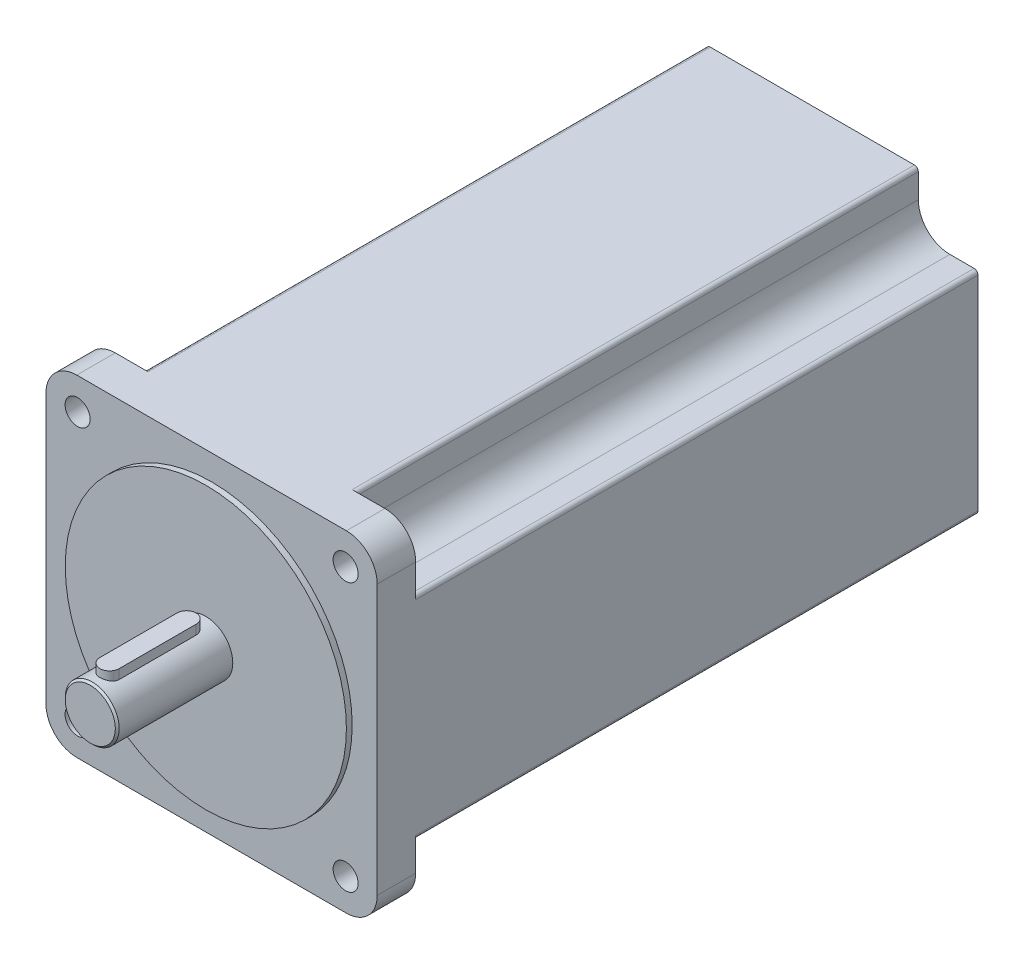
ISO-10303-21;
HEADER;
FILE_DESCRIPTION(('STEP AP214'),'2;1');
FILE_NAME('part.step','',(''),(''),'','','');
FILE_SCHEMA(('AUTOMOTIVE_DESIGN { 1 0 10303 214 1 1 1 1 }'));
ENDSEC;
DATA;
#1=APPLICATION_CONTEXT('core data for automotive mechanical design processes');
#2=APPLICATION_PROTOCOL_DEFINITION('international standard','automotive_design',2000,#1);
#3=PRODUCT_CONTEXT('',#1,'mechanical');
#4=PRODUCT('Part','Part','',(#3));
#5=PRODUCT_RELATED_PRODUCT_CATEGORY('part','',(#4));
#6=PRODUCT_DEFINITION_FORMATION('','',#4);
#7=PRODUCT_DEFINITION_CONTEXT('part definition',#1,'design');
#8=PRODUCT_DEFINITION('design','',#6,#7);
#9=PRODUCT_DEFINITION_SHAPE('','',#8);
#10=(LENGTH_UNIT() NAMED_UNIT(*) SI_UNIT(.MILLI.,.METRE.));
#11=(NAMED_UNIT(*) PLANE_ANGLE_UNIT() SI_UNIT($,.RADIAN.));
#12=(NAMED_UNIT(*) SI_UNIT($,.STERADIAN.) SOLID_ANGLE_UNIT());
#13=UNCERTAINTY_MEASURE_WITH_UNIT(LENGTH_MEASURE(1.E-05),#10,'distance_accuracy_value','');
#14=(GEOMETRIC_REPRESENTATION_CONTEXT(3) GLOBAL_UNCERTAINTY_ASSIGNED_CONTEXT((#13)) GLOBAL_UNIT_ASSIGNED_CONTEXT((#10,
#11,#12)) REPRESENTATION_CONTEXT('',''));
#15=CARTESIAN_POINT('',(0.,0.,0.));
#16=DIRECTION('',(0.,0.,1.));
#17=DIRECTION('',(1.,0.,0.));
#18=AXIS2_PLACEMENT_3D('',#15,#16,#17);
#19=CARTESIAN_POINT('',(0.,9.,25.));
#20=DIRECTION('',(0.,-1.,0.));
#21=DIRECTION('',(0.,0.,-1.));
#22=AXIS2_PLACEMENT_3D('',#19,#20,#21);
#23=CYLINDRICAL_SURFACE('',#22,2.5);
#24=CARTESIAN_POINT('',(0.,4.,25.));
#25=DIRECTION('',(0.,1.,0.));
#26=DIRECTION('',(0.,0.,1.));
#27=AXIS2_PLACEMENT_3D('',#24,#25,#26);
#28=CIRCLE('',#27,2.5);
#29=CARTESIAN_POINT('',(-2.5,4.,25.));
#30=VERTEX_POINT('',#29);
#31=CARTESIAN_POINT('',(2.5,4.,25.));
#32=VERTEX_POINT('',#31);
#33=EDGE_CURVE('E106',#30,#32,#28,.T.);
#34=ORIENTED_EDGE('',*,*,#33,.T.);
#35=DIRECTION('',(0.,-1.,0.));
#36=VECTOR('',#35,1.);
#37=CARTESIAN_POINT('',(2.5,9.,25.));
#38=LINE('',#37,#36);
#39=CARTESIAN_POINT('',(2.5,9.,25.));
#40=VERTEX_POINT('',#39);
#41=EDGE_CURVE('E12',#40,#32,#38,.T.);
#42=ORIENTED_EDGE('',*,*,#41,.F.);
#43=CARTESIAN_POINT('',(0.,9.,25.));
#44=DIRECTION('',(0.,1.,0.));
#45=DIRECTION('',(0.,0.,1.));
#46=AXIS2_PLACEMENT_3D('',#43,#44,#45);
#47=CIRCLE('',#46,2.5);
#48=CARTESIAN_POINT('',(-2.5,9.,25.));
#49=VERTEX_POINT('',#48);
#50=EDGE_CURVE('E94',#49,#40,#47,.T.);
#51=ORIENTED_EDGE('',*,*,#50,.F.);
#52=DIRECTION('',(0.,-1.,0.));
#53=VECTOR('',#52,1.);
#54=CARTESIAN_POINT('',(-2.5,9.,25.));
#55=LINE('',#54,#53);
#56=EDGE_CURVE('E102',#49,#30,#55,.T.);
#57=ORIENTED_EDGE('',*,*,#56,.T.);
#58=EDGE_LOOP('',(#34,#42,#51,#57));
#59=FACE_BOUND('',#58,.T.);
#60=ADVANCED_FACE('F43',(#59),#23,.T.);
#61=CARTESIAN_POINT('',(2.5,9.,5.));
#62=DIRECTION('',(-1.,0.,0.));
#63=DIRECTION('',(0.,0.,1.));
#64=AXIS2_PLACEMENT_3D('',#61,#62,#63);
#65=PLANE('',#64);
#66=DIRECTION('',(0.,0.,-1.));
#67=VECTOR('',#66,1.);
#68=CARTESIAN_POINT('',(2.5,4.,5.));
#69=LINE('',#68,#67);
#70=CARTESIAN_POINT('',(2.5,4.,5.));
#71=VERTEX_POINT('',#70);
#72=EDGE_CURVE('E98',#32,#71,#69,.T.);
#73=ORIENTED_EDGE('',*,*,#72,.T.);
#74=DIRECTION('',(0.,-1.,0.));
#75=VECTOR('',#74,1.);
#76=CARTESIAN_POINT('',(2.5,9.,5.));
#77=LINE('',#76,#75);
#78=CARTESIAN_POINT('',(2.5,9.,5.));
#79=VERTEX_POINT('',#78);
#80=EDGE_CURVE('E51',#79,#71,#77,.T.);
#81=ORIENTED_EDGE('',*,*,#80,.F.);
#82=DIRECTION('',(0.,0.,-1.));
#83=VECTOR('',#82,1.);
#84=CARTESIAN_POINT('',(2.5,9.,5.));
#85=LINE('',#84,#83);
#86=EDGE_CURVE('E89',#40,#79,#85,.T.);
#87=ORIENTED_EDGE('',*,*,#86,.F.);
#88=ORIENTED_EDGE('',*,*,#41,.T.);
#89=EDGE_LOOP('',(#73,#81,#87,#88));
#90=FACE_BOUND('',#89,.T.);
#91=ADVANCED_FACE('F97',(#90),#65,.F.);
#92=CARTESIAN_POINT('',(0.,9.,5.));
#93=DIRECTION('',(0.,-1.,0.));
#94=DIRECTION('',(0.,0.,-1.));
#95=AXIS2_PLACEMENT_3D('',#92,#93,#94);
#96=CYLINDRICAL_SURFACE('',#95,2.5);
#97=CARTESIAN_POINT('',(0.,4.,5.));
#98=DIRECTION('',(0.,1.,0.));
#99=DIRECTION('',(0.,0.,1.));
#100=AXIS2_PLACEMENT_3D('',#97,#98,#99);
#101=CIRCLE('',#100,2.5);
#102=CARTESIAN_POINT('',(-2.5,4.,5.));
#103=VERTEX_POINT('',#102);
#104=EDGE_CURVE('E76',#71,#103,#101,.T.);
#105=ORIENTED_EDGE('',*,*,#104,.T.);
#106=DIRECTION('',(0.,-1.,0.));
#107=VECTOR('',#106,1.);
#108=CARTESIAN_POINT('',(-2.5,9.,5.));
#109=LINE('',#108,#107);
#110=CARTESIAN_POINT('',(-2.5,9.,5.));
#111=VERTEX_POINT('',#110);
#112=EDGE_CURVE('E99',#111,#103,#109,.T.);
#113=ORIENTED_EDGE('',*,*,#112,.F.);
#114=CARTESIAN_POINT('',(0.,9.,5.));
#115=DIRECTION('',(0.,1.,0.));
#116=DIRECTION('',(0.,0.,1.));
#117=AXIS2_PLACEMENT_3D('',#114,#115,#116);
#118=CIRCLE('',#117,2.5);
#119=EDGE_CURVE('E92',#79,#111,#118,.T.);
#120=ORIENTED_EDGE('',*,*,#119,.F.);
#121=ORIENTED_EDGE('',*,*,#80,.T.);
#122=EDGE_LOOP('',(#105,#113,#120,#121));
#123=FACE_BOUND('',#122,.T.);
#124=ADVANCED_FACE('F100',(#123),#96,.T.);
#125=CARTESIAN_POINT('',(-2.5,9.,25.));
#126=DIRECTION('',(1.,0.,0.));
#127=DIRECTION('',(0.,0.,-1.));
#128=AXIS2_PLACEMENT_3D('',#125,#126,#127);
#129=PLANE('',#128);
#130=DIRECTION('',(0.,0.,1.));
#131=VECTOR('',#130,1.);
#132=CARTESIAN_POINT('',(-2.5,4.,25.));
#133=LINE('',#132,#131);
#134=EDGE_CURVE('E82',#103,#30,#133,.T.);
#135=ORIENTED_EDGE('',*,*,#134,.T.);
#136=ORIENTED_EDGE('',*,*,#56,.F.);
#137=DIRECTION('',(0.,0.,1.));
#138=VECTOR('',#137,1.);
#139=CARTESIAN_POINT('',(-2.5,9.,25.));
#140=LINE('',#139,#138);
#141=EDGE_CURVE('E59',#111,#49,#140,.T.);
#142=ORIENTED_EDGE('',*,*,#141,.F.);
#143=ORIENTED_EDGE('',*,*,#112,.T.);
#144=EDGE_LOOP('',(#135,#136,#142,#143));
#145=FACE_BOUND('',#144,.T.);
#146=ADVANCED_FACE('F113',(#145),#129,.F.);
#147=CARTESIAN_POINT('',(0.,9.,25.));
#148=DIRECTION('',(0.,1.,0.));
#149=DIRECTION('',(0.,0.,1.));
#150=AXIS2_PLACEMENT_3D('',#147,#148,#149);
#151=PLANE('',#150);
#152=ORIENTED_EDGE('',*,*,#50,.T.);
#153=ORIENTED_EDGE('',*,*,#86,.T.);
#154=ORIENTED_EDGE('',*,*,#119,.T.);
#155=ORIENTED_EDGE('',*,*,#141,.T.);
#156=EDGE_LOOP('',(#152,#153,#154,#155));
#157=FACE_BOUND('',#156,.T.);
#158=ADVANCED_FACE('F90',(#157),#151,.T.);
#159=CARTESIAN_POINT('',(0.,4.,25.));
#160=DIRECTION('',(0.,1.,0.));
#161=DIRECTION('',(0.,0.,1.));
#162=AXIS2_PLACEMENT_3D('',#159,#160,#161);
#163=PLANE('',#162);
#164=ORIENTED_EDGE('',*,*,#33,.F.);
#165=ORIENTED_EDGE('',*,*,#134,.F.);
#166=ORIENTED_EDGE('',*,*,#104,.F.);
#167=ORIENTED_EDGE('',*,*,#72,.F.);
#168=EDGE_LOOP('',(#164,#165,#166,#167));
#169=FACE_BOUND('',#168,.T.);
#170=ADVANCED_FACE('F116',(#169),#163,.F.);
#171=CLOSED_SHELL('',(#60,#91,#124,#146,#158,#170));
#172=MANIFOLD_SOLID_BREP('B2',#171);
#173=CARTESIAN_POINT('',(35.,-35.,-157.5));
#174=DIRECTION('',(0.,0.,1.));
#175=DIRECTION('',(1.,0.,0.));
#176=AXIS2_PLACEMENT_3D('',#173,#174,#175);
#177=CYLINDRICAL_SURFACE('',#176,8.);
#178=CARTESIAN_POINT('',(35.,-35.,-11.5));
#179=DIRECTION('',(0.,0.,-1.));
#180=DIRECTION('',(-1.,0.,0.));
#181=AXIS2_PLACEMENT_3D('',#178,#179,#180);
#182=CIRCLE('',#181,8.);
#183=CARTESIAN_POINT('',(43.,-35.,-11.5));
#184=VERTEX_POINT('',#183);
#185=CARTESIAN_POINT('',(34.9999999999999,-43.,-11.5));
#186=VERTEX_POINT('',#185);
#187=EDGE_CURVE('E475',#184,#186,#182,.T.);
#188=ORIENTED_EDGE('',*,*,#187,.F.);
#189=DIRECTION('',(0.,0.,1.));
#190=VECTOR('',#189,1.);
#191=CARTESIAN_POINT('',(43.,-35.,-157.5));
#192=LINE('',#191,#190);
#193=CARTESIAN_POINT('',(43.,-35.,-1.5));
#194=VERTEX_POINT('',#193);
#195=EDGE_CURVE('E654',#184,#194,#192,.T.);
#196=ORIENTED_EDGE('',*,*,#195,.T.);
#197=CARTESIAN_POINT('',(35.,-35.,-1.5));
#198=DIRECTION('',(0.,0.,-1.));
#199=DIRECTION('',(1.,0.,0.));
#200=AXIS2_PLACEMENT_3D('',#197,#198,#199);
#201=CIRCLE('',#200,8.);
#202=CARTESIAN_POINT('',(34.9999999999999,-43.,-1.5));
#203=VERTEX_POINT('',#202);
#204=EDGE_CURVE('E644',#194,#203,#201,.T.);
#205=ORIENTED_EDGE('',*,*,#204,.T.);
#206=DIRECTION('',(0.,0.,1.));
#207=VECTOR('',#206,1.);
#208=CARTESIAN_POINT('',(34.9999999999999,-43.,-157.5));
#209=LINE('',#208,#207);
#210=EDGE_CURVE('E690',#186,#203,#209,.T.);
#211=ORIENTED_EDGE('',*,*,#210,.F.);
#212=EDGE_LOOP('',(#188,#196,#205,#211));
#213=FACE_BOUND('',#212,.T.);
#214=ADVANCED_FACE('F167',(#213),#177,.T.);
#215=CARTESIAN_POINT('',(34.8,-34.8,-157.5));
#216=DIRECTION('',(0.,0.,1.));
#217=DIRECTION('',(1.,0.,0.));
#218=AXIS2_PLACEMENT_3D('',#215,#216,#217);
#219=CYLINDRICAL_SURFACE('',#218,3.25);
#220=CARTESIAN_POINT('',(34.8,-34.8,-1.5));
#221=DIRECTION('',(0.,0.,-1.));
#222=DIRECTION('',(-1.,0.,0.));
#223=AXIS2_PLACEMENT_3D('',#220,#221,#222);
#224=CIRCLE('',#223,3.25);
#225=CARTESIAN_POINT('',(31.55,-34.8,-1.5));
#226=VERTEX_POINT('',#225);
#227=EDGE_CURVE('E632',#226,#226,#224,.T.);
#228=ORIENTED_EDGE('',*,*,#227,.F.);
#229=EDGE_LOOP('',(#228));
#230=FACE_BOUND('',#229,.T.);
#231=CARTESIAN_POINT('',(34.8,-34.8,-11.5));
#232=DIRECTION('',(0.,0.,-1.));
#233=DIRECTION('',(-1.,0.,0.));
#234=AXIS2_PLACEMENT_3D('',#231,#232,#233);
#235=CIRCLE('',#234,3.25);
#236=CARTESIAN_POINT('',(31.55,-34.8,-11.5));
#237=VERTEX_POINT('',#236);
#238=EDGE_CURVE('E462',#237,#237,#235,.T.);
#239=ORIENTED_EDGE('',*,*,#238,.T.);
#240=EDGE_LOOP('',(#239));
#241=FACE_BOUND('',#240,.T.);
#242=ADVANCED_FACE('F835',(#230,#241),#219,.F.);
#243=CARTESIAN_POINT('',(-35.,-35.,-157.5));
#244=DIRECTION('',(0.,0.,1.));
#245=DIRECTION('',(1.,0.,0.));
#246=AXIS2_PLACEMENT_3D('',#243,#244,#245);
#247=CYLINDRICAL_SURFACE('',#246,8.);
#248=CARTESIAN_POINT('',(-35.,-35.,-11.5));
#249=DIRECTION('',(0.,0.,-1.));
#250=DIRECTION('',(-1.,0.,0.));
#251=AXIS2_PLACEMENT_3D('',#248,#249,#250);
#252=CIRCLE('',#251,8.);
#253=CARTESIAN_POINT('',(-35.,-43.,-11.5));
#254=VERTEX_POINT('',#253);
#255=CARTESIAN_POINT('',(-43.,-34.9999999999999,-11.5));
#256=VERTEX_POINT('',#255);
#257=EDGE_CURVE('E525',#254,#256,#252,.T.);
#258=ORIENTED_EDGE('',*,*,#257,.F.);
#259=DIRECTION('',(0.,0.,1.));
#260=VECTOR('',#259,1.);
#261=CARTESIAN_POINT('',(-35.,-43.,-157.5));
#262=LINE('',#261,#260);
#263=CARTESIAN_POINT('',(-35.,-43.,-1.5));
#264=VERTEX_POINT('',#263);
#265=EDGE_CURVE('E688',#254,#264,#262,.T.);
#266=ORIENTED_EDGE('',*,*,#265,.T.);
#267=CARTESIAN_POINT('',(-35.,-35.,-1.5));
#268=DIRECTION('',(0.,0.,-1.));
#269=DIRECTION('',(1.,0.,0.));
#270=AXIS2_PLACEMENT_3D('',#267,#268,#269);
#271=CIRCLE('',#270,8.);
#272=CARTESIAN_POINT('',(-43.,-34.9999999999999,-1.5));
#273=VERTEX_POINT('',#272);
#274=EDGE_CURVE('E660',#264,#273,#271,.T.);
#275=ORIENTED_EDGE('',*,*,#274,.T.);
#276=DIRECTION('',(0.,0.,1.));
#277=VECTOR('',#276,1.);
#278=CARTESIAN_POINT('',(-43.,-34.9999999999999,-157.5));
#279=LINE('',#278,#277);
#280=EDGE_CURVE('E686',#256,#273,#279,.T.);
#281=ORIENTED_EDGE('',*,*,#280,.F.);
#282=EDGE_LOOP('',(#258,#266,#275,#281));
#283=FACE_BOUND('',#282,.T.);
#284=ADVANCED_FACE('F838',(#283),#247,.T.);
#285=CARTESIAN_POINT('',(-34.8,-34.8,-157.5));
#286=DIRECTION('',(0.,0.,1.));
#287=DIRECTION('',(1.,0.,0.));
#288=AXIS2_PLACEMENT_3D('',#285,#286,#287);
#289=CYLINDRICAL_SURFACE('',#288,3.25);
#290=CARTESIAN_POINT('',(-34.8,-34.8,-1.5));
#291=DIRECTION('',(0.,0.,-1.));
#292=DIRECTION('',(-1.,0.,0.));
#293=AXIS2_PLACEMENT_3D('',#290,#291,#292);
#294=CIRCLE('',#293,3.25);
#295=CARTESIAN_POINT('',(-38.05,-34.8,-1.5));
#296=VERTEX_POINT('',#295);
#297=EDGE_CURVE('E635',#296,#296,#294,.T.);
#298=ORIENTED_EDGE('',*,*,#297,.F.);
#299=EDGE_LOOP('',(#298));
#300=FACE_BOUND('',#299,.T.);
#301=CARTESIAN_POINT('',(-34.8,-34.8,-11.5));
#302=DIRECTION('',(0.,0.,-1.));
#303=DIRECTION('',(-1.,0.,0.));
#304=AXIS2_PLACEMENT_3D('',#301,#302,#303);
#305=CIRCLE('',#304,3.25);
#306=CARTESIAN_POINT('',(-38.05,-34.8,-11.5));
#307=VERTEX_POINT('',#306);
#308=EDGE_CURVE('E512',#307,#307,#305,.T.);
#309=ORIENTED_EDGE('',*,*,#308,.T.);
#310=EDGE_LOOP('',(#309));
#311=FACE_BOUND('',#310,.T.);
#312=ADVANCED_FACE('F840',(#300,#311),#289,.F.);
#313=CARTESIAN_POINT('',(35.,35.,-157.5));
#314=DIRECTION('',(0.,0.,1.));
#315=DIRECTION('',(1.,0.,0.));
#316=AXIS2_PLACEMENT_3D('',#313,#314,#315);
#317=CYLINDRICAL_SURFACE('',#316,8.);
#318=CARTESIAN_POINT('',(35.,35.,-11.5));
#319=DIRECTION('',(0.,0.,-1.));
#320=DIRECTION('',(-1.,0.,0.));
#321=AXIS2_PLACEMENT_3D('',#318,#319,#320);
#322=CIRCLE('',#321,8.);
#323=CARTESIAN_POINT('',(34.9999999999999,43.,-11.5));
#324=VERTEX_POINT('',#323);
#325=CARTESIAN_POINT('',(43.,34.9999999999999,-11.5));
#326=VERTEX_POINT('',#325);
#327=EDGE_CURVE('E575',#324,#326,#322,.T.);
#328=ORIENTED_EDGE('',*,*,#327,.F.);
#329=DIRECTION('',(0.,0.,1.));
#330=VECTOR('',#329,1.);
#331=CARTESIAN_POINT('',(34.9999999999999,43.,-157.5));
#332=LINE('',#331,#330);
#333=CARTESIAN_POINT('',(34.9999999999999,43.,-1.5));
#334=VERTEX_POINT('',#333);
#335=EDGE_CURVE('E680',#324,#334,#332,.T.);
#336=ORIENTED_EDGE('',*,*,#335,.T.);
#337=CARTESIAN_POINT('',(35.,35.,-1.5));
#338=DIRECTION('',(0.,0.,-1.));
#339=DIRECTION('',(1.,0.,0.));
#340=AXIS2_PLACEMENT_3D('',#337,#338,#339);
#341=CIRCLE('',#340,8.);
#342=CARTESIAN_POINT('',(43.,34.9999999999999,-1.5));
#343=VERTEX_POINT('',#342);
#344=EDGE_CURVE('E672',#334,#343,#341,.T.);
#345=ORIENTED_EDGE('',*,*,#344,.T.);
#346=DIRECTION('',(0.,0.,1.));
#347=VECTOR('',#346,1.);
#348=CARTESIAN_POINT('',(43.,34.9999999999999,-157.5));
#349=LINE('',#348,#347);
#350=EDGE_CURVE('E678',#326,#343,#349,.T.);
#351=ORIENTED_EDGE('',*,*,#350,.F.);
#352=EDGE_LOOP('',(#328,#336,#345,#351));
#353=FACE_BOUND('',#352,.T.);
#354=ADVANCED_FACE('F843',(#353),#317,.T.);
#355=CARTESIAN_POINT('',(34.8,34.8,-157.5));
#356=DIRECTION('',(0.,0.,1.));
#357=DIRECTION('',(1.,0.,0.));
#358=AXIS2_PLACEMENT_3D('',#355,#356,#357);
#359=CYLINDRICAL_SURFACE('',#358,3.25);
#360=CARTESIAN_POINT('',(34.8,34.8,-1.5));
#361=DIRECTION('',(0.,0.,-1.));
#362=DIRECTION('',(-1.,0.,0.));
#363=AXIS2_PLACEMENT_3D('',#360,#361,#362);
#364=CIRCLE('',#363,3.25);
#365=CARTESIAN_POINT('',(31.55,34.8,-1.5));
#366=VERTEX_POINT('',#365);
#367=EDGE_CURVE('E641',#366,#366,#364,.T.);
#368=ORIENTED_EDGE('',*,*,#367,.F.);
#369=EDGE_LOOP('',(#368));
#370=FACE_BOUND('',#369,.T.);
#371=CARTESIAN_POINT('',(34.8,34.8,-11.5));
#372=DIRECTION('',(0.,0.,-1.));
#373=DIRECTION('',(-1.,0.,0.));
#374=AXIS2_PLACEMENT_3D('',#371,#372,#373);
#375=CIRCLE('',#374,3.25);
#376=CARTESIAN_POINT('',(31.55,34.8,-11.5));
#377=VERTEX_POINT('',#376);
#378=EDGE_CURVE('E562',#377,#377,#375,.T.);
#379=ORIENTED_EDGE('',*,*,#378,.T.);
#380=EDGE_LOOP('',(#379));
#381=FACE_BOUND('',#380,.T.);
#382=ADVANCED_FACE('F849',(#370,#381),#359,.F.);
#383=CARTESIAN_POINT('',(0.,0.,0.));
#384=DIRECTION('',(0.,0.,1.));
#385=DIRECTION('',(1.,0.,0.));
#386=AXIS2_PLACEMENT_3D('',#383,#384,#385);
#387=PLANE('',#386);
#388=CARTESIAN_POINT('',(0.,0.,0.));
#389=DIRECTION('',(0.,0.,1.));
#390=DIRECTION('',(1.,0.,0.));
#391=AXIS2_PLACEMENT_3D('',#388,#389,#390);
#392=CIRCLE('',#391,36.5);
#393=CARTESIAN_POINT('',(36.5,0.,0.));
#394=VERTEX_POINT('',#393);
#395=EDGE_CURVE('E698',#394,#394,#392,.T.);
#396=ORIENTED_EDGE('',*,*,#395,.T.);
#397=EDGE_LOOP('',(#396));
#398=FACE_BOUND('',#397,.T.);
#399=CARTESIAN_POINT('',(0.,0.,0.));
#400=DIRECTION('',(0.,0.,1.));
#401=DIRECTION('',(1.,0.,0.));
#402=AXIS2_PLACEMENT_3D('',#399,#400,#401);
#403=CIRCLE('',#402,7.);
#404=CARTESIAN_POINT('',(7.,0.,0.));
#405=VERTEX_POINT('',#404);
#406=EDGE_CURVE('E695',#405,#405,#403,.T.);
#407=ORIENTED_EDGE('',*,*,#406,.F.);
#408=EDGE_LOOP('',(#407));
#409=FACE_BOUND('',#408,.T.);
#410=ADVANCED_FACE('F852',(#398,#409),#387,.T.);
#411=CARTESIAN_POINT('',(0.,0.,-1.5));
#412=DIRECTION('',(0.,0.,1.));
#413=DIRECTION('',(1.,0.,0.));
#414=AXIS2_PLACEMENT_3D('',#411,#412,#413);
#415=CYLINDRICAL_SURFACE('',#414,36.5);
#416=CARTESIAN_POINT('',(0.,0.,-1.5));
#417=DIRECTION('',(0.,0.,1.));
#418=DIRECTION('',(1.,0.,0.));
#419=AXIS2_PLACEMENT_3D('',#416,#417,#418);
#420=CIRCLE('',#419,36.5);
#421=CARTESIAN_POINT('',(36.5,0.,-1.5));
#422=VERTEX_POINT('',#421);
#423=EDGE_CURVE('E692',#422,#422,#420,.F.);
#424=ORIENTED_EDGE('',*,*,#423,.F.);
#425=EDGE_LOOP('',(#424));
#426=FACE_BOUND('',#425,.T.);
#427=ORIENTED_EDGE('',*,*,#395,.F.);
#428=EDGE_LOOP('',(#427));
#429=FACE_BOUND('',#428,.T.);
#430=ADVANCED_FACE('F895',(#426,#429),#415,.T.);
#431=CARTESIAN_POINT('',(0.,0.,30.));
#432=DIRECTION('',(0.,0.,-1.));
#433=DIRECTION('',(-1.,0.,0.));
#434=AXIS2_PLACEMENT_3D('',#431,#432,#433);
#435=CYLINDRICAL_SURFACE('',#434,7.);
#436=CARTESIAN_POINT('',(0.,0.,29.5));
#437=DIRECTION('',(0.,0.,1.));
#438=DIRECTION('',(1.,0.,0.));
#439=AXIS2_PLACEMENT_3D('',#436,#437,#438);
#440=CIRCLE('',#439,7.);
#441=CARTESIAN_POINT('',(7.,0.,29.5));
#442=VERTEX_POINT('',#441);
#443=EDGE_CURVE('E41',#442,#442,#440,.F.);
#444=ORIENTED_EDGE('',*,*,#443,.T.);
#445=EDGE_LOOP('',(#444));
#446=FACE_BOUND('',#445,.T.);
#447=DIRECTION('',(0.,0.,-1.));
#448=VECTOR('',#447,1.);
#449=CARTESIAN_POINT('',(-2.5,6.53834841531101,30.));
#450=LINE('',#449,#448);
#451=CARTESIAN_POINT('',(-2.5,6.53834841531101,25.));
#452=VERTEX_POINT('',#451);
#453=CARTESIAN_POINT('',(-2.5,6.53834841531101,5.));
#454=VERTEX_POINT('',#453);
#455=EDGE_CURVE('E900',#452,#454,#450,.T.);
#456=ORIENTED_EDGE('',*,*,#455,.T.);
#457=CARTESIAN_POINT('',(-2.5,6.53834841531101,5.));
#458=CARTESIAN_POINT('',(-2.50000932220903,6.53833653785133,4.93211075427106));
#459=CARTESIAN_POINT('',(-2.49723485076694,6.53940549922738,4.86422806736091));
#460=CARTESIAN_POINT('',(-2.4861910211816,6.54361657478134,4.72899608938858));
#461=CARTESIAN_POINT('',(-2.47792334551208,6.54675805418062,4.66164664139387));
#462=CARTESIAN_POINT('',(-2.456001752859,6.55501217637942,4.52817858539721));
#463=CARTESIAN_POINT('',(-2.44236559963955,6.56011831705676,4.46205666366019));
#464=CARTESIAN_POINT('',(-2.40985115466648,6.57213177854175,4.33129816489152));
#465=CARTESIAN_POINT('',(-2.39097263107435,6.57903917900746,4.26666165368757));
#466=CARTESIAN_POINT('',(-2.32673964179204,6.6021493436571,4.07573563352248));
#467=CARTESIAN_POINT('',(-2.27375112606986,6.62075475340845,3.95220954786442));
#468=CARTESIAN_POINT('',(-2.14910757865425,6.6622539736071,3.71576966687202));
#469=CARTESIAN_POINT('',(-2.07743895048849,6.68515090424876,3.60286368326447));
#470=CARTESIAN_POINT('',(-1.9140257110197,6.73379913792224,3.38578478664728));
#471=CARTESIAN_POINT('',(-1.82158337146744,6.75962864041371,3.28215352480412));
#472=CARTESIAN_POINT('',(-1.6207338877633,6.81057592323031,3.09149129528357));
#473=CARTESIAN_POINT('',(-1.51232377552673,6.83569357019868,3.00446342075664));
#474=CARTESIAN_POINT('',(-1.27853915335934,6.88331133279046,2.84691014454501));
#475=CARTESIAN_POINT('',(-1.15274833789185,6.90570835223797,2.77696847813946));
#476=CARTESIAN_POINT('',(-0.890250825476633,6.94442357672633,2.65946335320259));
#477=CARTESIAN_POINT('',(-0.753547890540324,6.96074386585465,2.61189222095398));
#478=CARTESIAN_POINT('',(-0.478829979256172,6.9849105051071,2.54235939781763));
#479=CARTESIAN_POINT('',(-0.341079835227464,6.99306594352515,2.51946086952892));
#480=CARTESIAN_POINT('',(-0.0634643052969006,7.00108798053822,2.49693159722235));
#481=CARTESIAN_POINT('',(0.0764004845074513,7.00095687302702,2.49729441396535));
#482=CARTESIAN_POINT('',(0.347593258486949,6.99262258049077,2.52071127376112));
#483=CARTESIAN_POINT('',(0.479022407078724,6.98478243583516,2.54274479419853));
#484=CARTESIAN_POINT('',(0.736175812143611,6.96237832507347,2.6071734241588));
#485=CARTESIAN_POINT('',(0.861899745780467,6.94781397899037,2.64956968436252));
#486=CARTESIAN_POINT('',(1.10616102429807,6.91316506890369,2.75404691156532));
#487=CARTESIAN_POINT('',(1.22457279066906,6.89300592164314,2.81639571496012));
#488=CARTESIAN_POINT('',(1.44953531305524,6.8492335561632,2.95877933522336));
#489=CARTESIAN_POINT('',(1.55608245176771,6.82561928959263,3.03881952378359));
#490=CARTESIAN_POINT('',(1.7603244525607,6.7759054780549,3.2193232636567));
#491=CARTESIAN_POINT('',(1.85724185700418,6.74974055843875,3.3206497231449));
#492=CARTESIAN_POINT('',(2.03299914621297,6.69890342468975,3.53832736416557));
#493=CARTESIAN_POINT('',(2.11183255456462,6.67423174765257,3.65468390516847));
#494=CARTESIAN_POINT('',(2.25049860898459,6.62877803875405,3.90194259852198));
#495=CARTESIAN_POINT('',(2.30994207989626,6.60807875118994,4.03307897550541));
#496=CARTESIAN_POINT('',(2.4055543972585,6.57388213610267,4.30436480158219));
#497=CARTESIAN_POINT('',(2.44176119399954,6.56037307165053,4.44449914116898));
#498=CARTESIAN_POINT('',(2.47705497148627,6.54708542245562,4.65503054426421));
#499=CARTESIAN_POINT('',(2.48565347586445,6.54382010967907,4.72373630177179));
#500=CARTESIAN_POINT('',(2.49712352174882,6.53944910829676,4.86161516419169));
#501=CARTESIAN_POINT('',(2.50000139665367,6.53834103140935,4.93078766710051));
#502=CARTESIAN_POINT('',(2.5,6.53834841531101,5.));
#503=B_SPLINE_CURVE_WITH_KNOTS('',3,(#457,#458,#459,#460,#461,#462,#463,#464,#465,#466,#467,
#468,#469,#470,#471,#472,#473,#474,#475,#476,#477,#478,#479,#480,#481,#482,#483,#484,#485,#486,
#487,#488,#489,#490,#491,#492,#493,#494,#495,#496,#497,#498,#499,#500,#501,#502),.UNSPECIFIED.,
.F.,.F.,(4,2,2,2,2,2,2,2,2,2,2,2,2,2,2,2,2,2,2,2,2,2,4),(0.,0.20359162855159,0.40712092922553,
0.609982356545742,0.81285275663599,1.21793118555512,1.6233052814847,2.0451597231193,
2.4670926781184,2.90188398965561,3.33652604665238,3.75400993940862,4.17137826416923,
4.56998920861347,4.96862268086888,5.37284909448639,5.77719841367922,6.20315837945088,
6.62927065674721,7.06347329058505,7.49696496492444,7.70468580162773,7.91217653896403),.UNSPECIFIED.);
#504=CARTESIAN_POINT('',(2.5,6.53834841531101,5.));
#505=VERTEX_POINT('',#504);
#506=EDGE_CURVE('E701',#454,#505,#503,.T.);
#507=ORIENTED_EDGE('',*,*,#506,.T.);
#508=DIRECTION('',(0.,0.,-1.));
#509=VECTOR('',#508,1.);
#510=CARTESIAN_POINT('',(2.5,6.53834841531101,30.));
#511=LINE('',#510,#509);
#512=CARTESIAN_POINT('',(2.5,6.53834841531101,25.));
#513=VERTEX_POINT('',#512);
#514=EDGE_CURVE('E902',#505,#513,#511,.F.);
#515=ORIENTED_EDGE('',*,*,#514,.T.);
#516=CARTESIAN_POINT('',(2.5,6.53834841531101,25.));
#517=CARTESIAN_POINT('',(2.50000932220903,6.53833653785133,25.0678892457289));
#518=CARTESIAN_POINT('',(2.49723485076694,6.53940549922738,25.1357719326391));
#519=CARTESIAN_POINT('',(2.4861910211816,6.54361657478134,25.2710039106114));
#520=CARTESIAN_POINT('',(2.47792334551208,6.54675805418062,25.3383533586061));
#521=CARTESIAN_POINT('',(2.456001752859,6.55501217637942,25.4718214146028));
#522=CARTESIAN_POINT('',(2.44236559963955,6.56011831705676,25.5379433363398));
#523=CARTESIAN_POINT('',(2.40985115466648,6.57213177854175,25.6687018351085));
#524=CARTESIAN_POINT('',(2.39097263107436,6.57903917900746,25.7333383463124));
#525=CARTESIAN_POINT('',(2.32673964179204,6.6021493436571,25.9242643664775));
#526=CARTESIAN_POINT('',(2.27375112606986,6.62075475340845,26.0477904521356));
#527=CARTESIAN_POINT('',(2.14910757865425,6.6622539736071,26.284230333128));
#528=CARTESIAN_POINT('',(2.07743895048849,6.68515090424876,26.3971363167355));
#529=CARTESIAN_POINT('',(1.9140257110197,6.73379913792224,26.6142152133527));
#530=CARTESIAN_POINT('',(1.82158337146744,6.75962864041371,26.7178464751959));
#531=CARTESIAN_POINT('',(1.6207338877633,6.81057592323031,26.9085087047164));
#532=CARTESIAN_POINT('',(1.51232377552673,6.83569357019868,26.9955365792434));
#533=CARTESIAN_POINT('',(1.27853915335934,6.88331133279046,27.153089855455));
#534=CARTESIAN_POINT('',(1.15274833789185,6.90570835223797,27.2230315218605));
#535=CARTESIAN_POINT('',(0.890250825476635,6.94442357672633,27.3405366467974));
#536=CARTESIAN_POINT('',(0.753547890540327,6.96074386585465,27.388107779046));
#537=CARTESIAN_POINT('',(0.478829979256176,6.9849105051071,27.4576406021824));
#538=CARTESIAN_POINT('',(0.341079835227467,6.99306594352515,27.4805391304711));
#539=CARTESIAN_POINT('',(0.0634643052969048,7.00108798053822,27.5030684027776));
#540=CARTESIAN_POINT('',(-0.076400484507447,7.00095687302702,27.5027055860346));
#541=CARTESIAN_POINT('',(-0.347593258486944,6.99262258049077,27.4792887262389));
#542=CARTESIAN_POINT('',(-0.479022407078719,6.98478243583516,27.4572552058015));
#543=CARTESIAN_POINT('',(-0.736175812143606,6.96237832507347,27.3928265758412));
#544=CARTESIAN_POINT('',(-0.861899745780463,6.94781397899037,27.3504303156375));
#545=CARTESIAN_POINT('',(-1.10616102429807,6.91316506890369,27.2459530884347));
#546=CARTESIAN_POINT('',(-1.22457279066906,6.89300592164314,27.1836042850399));
#547=CARTESIAN_POINT('',(-1.44953531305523,6.8492335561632,27.0412206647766));
#548=CARTESIAN_POINT('',(-1.5560824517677,6.82561928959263,26.9611804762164));
#549=CARTESIAN_POINT('',(-1.7603244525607,6.7759054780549,26.7806767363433));
#550=CARTESIAN_POINT('',(-1.85724185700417,6.74974055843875,26.6793502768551));
#551=CARTESIAN_POINT('',(-2.03299914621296,6.69890342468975,26.4616726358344));
#552=CARTESIAN_POINT('',(-2.11183255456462,6.67423174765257,26.3453160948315));
#553=CARTESIAN_POINT('',(-2.25049860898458,6.62877803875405,26.098057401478));
#554=CARTESIAN_POINT('',(-2.30994207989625,6.60807875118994,25.9669210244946));
#555=CARTESIAN_POINT('',(-2.4055543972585,6.57388213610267,25.6956351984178));
#556=CARTESIAN_POINT('',(-2.44176119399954,6.56037307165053,25.555500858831));
#557=CARTESIAN_POINT('',(-2.47705497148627,6.54708542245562,25.3449694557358));
#558=CARTESIAN_POINT('',(-2.48565347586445,6.54382010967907,25.2762636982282));
#559=CARTESIAN_POINT('',(-2.49712352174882,6.53944910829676,25.1383848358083));
#560=CARTESIAN_POINT('',(-2.50000139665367,6.53834103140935,25.0692123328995));
#561=CARTESIAN_POINT('',(-2.5,6.53834841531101,25.));
#562=B_SPLINE_CURVE_WITH_KNOTS('',3,(#516,#517,#518,#519,#520,#521,#522,#523,#524,#525,#526,
#527,#528,#529,#530,#531,#532,#533,#534,#535,#536,#537,#538,#539,#540,#541,#542,#543,#544,#545,
#546,#547,#548,#549,#550,#551,#552,#553,#554,#555,#556,#557,#558,#559,#560,#561),.UNSPECIFIED.,
.F.,.F.,(4,2,2,2,2,2,2,2,2,2,2,2,2,2,2,2,2,2,2,2,2,2,4),(0.,0.203591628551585,0.407120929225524,
0.609982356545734,0.812852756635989,1.21793118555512,1.6233052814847,2.0451597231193,
2.4670926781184,2.90188398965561,3.33652604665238,3.75400993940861,4.17137826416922,
4.56998920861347,4.96862268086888,5.37284909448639,5.77719841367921,6.20315837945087,
6.6292706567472,7.06347329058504,7.49696496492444,7.70468580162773,7.91217653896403),.UNSPECIFIED.);
#563=EDGE_CURVE('E182',#513,#452,#562,.T.);
#564=ORIENTED_EDGE('',*,*,#563,.T.);
#565=EDGE_LOOP('',(#456,#507,#515,#564));
#566=FACE_BOUND('',#565,.T.);
#567=ORIENTED_EDGE('',*,*,#406,.T.);
#568=EDGE_LOOP('',(#567));
#569=FACE_BOUND('',#568,.T.);
#570=ADVANCED_FACE('F722',(#446,#566,#569),#435,.T.);
#571=CARTESIAN_POINT('',(0.,0.,30.));
#572=DIRECTION('',(0.,0.,1.));
#573=DIRECTION('',(1.,0.,0.));
#574=AXIS2_PLACEMENT_3D('',#571,#572,#573);
#575=PLANE('',#574);
#576=CARTESIAN_POINT('',(0.,0.,30.));
#577=DIRECTION('',(0.,0.,1.));
#578=DIRECTION('',(1.,0.,0.));
#579=AXIS2_PLACEMENT_3D('',#576,#577,#578);
#580=CIRCLE('',#579,6.50000000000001);
#581=CARTESIAN_POINT('',(6.50000000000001,0.,30.));
#582=VERTEX_POINT('',#581);
#583=EDGE_CURVE('E175',#582,#582,#580,.T.);
#584=ORIENTED_EDGE('',*,*,#583,.T.);
#585=EDGE_LOOP('',(#584));
#586=FACE_BOUND('',#585,.T.);
#587=ADVANCED_FACE('F858',(#586),#575,.T.);
#588=CARTESIAN_POINT('',(35.,-35.,-157.5));
#589=DIRECTION('',(0.,0.,1.));
#590=DIRECTION('',(1.,0.,0.));
#591=AXIS2_PLACEMENT_3D('',#588,#589,#590);
#592=PLANE('',#591);
#593=DIRECTION('',(0.,1.,0.));
#594=VECTOR('',#593,1.);
#595=CARTESIAN_POINT('',(27.5,-42.,-157.5));
#596=LINE('',#595,#594);
#597=CARTESIAN_POINT('',(27.5,-42.,-157.5));
#598=VERTEX_POINT('',#597);
#599=CARTESIAN_POINT('',(27.5,-35.7000000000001,-157.5));
#600=VERTEX_POINT('',#599);
#601=EDGE_CURVE('E437',#598,#600,#596,.T.);
#602=ORIENTED_EDGE('',*,*,#601,.F.);
#603=CARTESIAN_POINT('',(26.5,-42.,-157.5));
#604=DIRECTION('',(0.,0.,1.));
#605=DIRECTION('',(1.,0.,0.));
#606=AXIS2_PLACEMENT_3D('',#603,#604,#605);
#607=CIRCLE('',#606,0.999999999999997);
#608=CARTESIAN_POINT('',(26.5,-43.,-157.5));
#609=VERTEX_POINT('',#608);
#610=EDGE_CURVE('E455',#609,#598,#607,.T.);
#611=ORIENTED_EDGE('',*,*,#610,.F.);
#612=DIRECTION('',(-1.,0.,0.));
#613=VECTOR('',#612,1.);
#614=CARTESIAN_POINT('',(-35.,-43.,-157.5));
#615=LINE('',#614,#613);
#616=CARTESIAN_POINT('',(-26.5,-43.,-157.5));
#617=VERTEX_POINT('',#616);
#618=EDGE_CURVE('E645',#609,#617,#615,.T.);
#619=ORIENTED_EDGE('',*,*,#618,.T.);
#620=CARTESIAN_POINT('',(-26.5,-42.,-157.5));
#621=DIRECTION('',(0.,0.,1.));
#622=DIRECTION('',(-1.,0.,0.));
#623=AXIS2_PLACEMENT_3D('',#620,#621,#622);
#624=CIRCLE('',#623,1.);
#625=CARTESIAN_POINT('',(-27.5,-42.,-157.5));
#626=VERTEX_POINT('',#625);
#627=EDGE_CURVE('E479',#626,#617,#624,.T.);
#628=ORIENTED_EDGE('',*,*,#627,.F.);
#629=DIRECTION('',(0.,-1.,0.));
#630=VECTOR('',#629,1.);
#631=CARTESIAN_POINT('',(-27.5,-42.,-157.5));
#632=LINE('',#631,#630);
#633=CARTESIAN_POINT('',(-27.5,-35.7000000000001,-157.5));
#634=VERTEX_POINT('',#633);
#635=EDGE_CURVE('E484',#634,#626,#632,.T.);
#636=ORIENTED_EDGE('',*,*,#635,.F.);
#637=CARTESIAN_POINT('',(-35.7,-35.7,-157.5));
#638=DIRECTION('',(0.,0.,-1.));
#639=DIRECTION('',(1.,0.,0.));
#640=AXIS2_PLACEMENT_3D('',#637,#638,#639);
#641=CIRCLE('',#640,8.19999999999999);
#642=CARTESIAN_POINT('',(-35.7,-27.5,-157.5));
#643=VERTEX_POINT('',#642);
#644=EDGE_CURVE('E505',#643,#634,#641,.T.);
#645=ORIENTED_EDGE('',*,*,#644,.F.);
#646=DIRECTION('',(1.,0.,0.));
#647=VECTOR('',#646,1.);
#648=CARTESIAN_POINT('',(-35.7,-27.5,-157.5));
#649=LINE('',#648,#647);
#650=CARTESIAN_POINT('',(-42.,-27.5,-157.5));
#651=VERTEX_POINT('',#650);
#652=EDGE_CURVE('E502',#651,#643,#649,.T.);
#653=ORIENTED_EDGE('',*,*,#652,.F.);
#654=CARTESIAN_POINT('',(-42.,-26.5,-157.5));
#655=DIRECTION('',(0.,0.,1.));
#656=DIRECTION('',(-1.,0.,0.));
#657=AXIS2_PLACEMENT_3D('',#654,#655,#656);
#658=CIRCLE('',#657,1.);
#659=CARTESIAN_POINT('',(-43.,-26.5,-157.5));
#660=VERTEX_POINT('',#659);
#661=EDGE_CURVE('E499',#660,#651,#658,.T.);
#662=ORIENTED_EDGE('',*,*,#661,.F.);
#663=DIRECTION('',(0.,1.,0.));
#664=VECTOR('',#663,1.);
#665=CARTESIAN_POINT('',(-43.,34.9999999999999,-157.5));
#666=LINE('',#665,#664);
#667=CARTESIAN_POINT('',(-43.,26.5,-157.5));
#668=VERTEX_POINT('',#667);
#669=EDGE_CURVE('E647',#660,#668,#666,.T.);
#670=ORIENTED_EDGE('',*,*,#669,.T.);
#671=CARTESIAN_POINT('',(-42.,26.5,-157.5));
#672=DIRECTION('',(0.,0.,1.));
#673=DIRECTION('',(1.,0.,0.));
#674=AXIS2_PLACEMENT_3D('',#671,#672,#673);
#675=CIRCLE('',#674,1.);
#676=CARTESIAN_POINT('',(-42.,27.5,-157.5));
#677=VERTEX_POINT('',#676);
#678=EDGE_CURVE('E584',#677,#668,#675,.T.);
#679=ORIENTED_EDGE('',*,*,#678,.F.);
#680=DIRECTION('',(-1.,0.,0.));
#681=VECTOR('',#680,1.);
#682=CARTESIAN_POINT('',(-35.7000000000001,27.5,-157.5));
#683=LINE('',#682,#681);
#684=CARTESIAN_POINT('',(-35.7000000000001,27.5,-157.5));
#685=VERTEX_POINT('',#684);
#686=EDGE_CURVE('E605',#685,#677,#683,.T.);
#687=ORIENTED_EDGE('',*,*,#686,.F.);
#688=CARTESIAN_POINT('',(-35.7,35.7,-157.5));
#689=DIRECTION('',(0.,0.,-1.));
#690=DIRECTION('',(-1.,0.,0.));
#691=AXIS2_PLACEMENT_3D('',#688,#689,#690);
#692=CIRCLE('',#691,8.2);
#693=CARTESIAN_POINT('',(-27.5,35.7000000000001,-157.5));
#694=VERTEX_POINT('',#693);
#695=EDGE_CURVE('E602',#694,#685,#692,.T.);
#696=ORIENTED_EDGE('',*,*,#695,.F.);
#697=DIRECTION('',(0.,-1.,0.));
#698=VECTOR('',#697,1.);
#699=CARTESIAN_POINT('',(-27.5,42.,-157.5));
#700=LINE('',#699,#698);
#701=CARTESIAN_POINT('',(-27.5,42.,-157.5));
#702=VERTEX_POINT('',#701);
#703=EDGE_CURVE('E599',#702,#694,#700,.T.);
#704=ORIENTED_EDGE('',*,*,#703,.F.);
#705=CARTESIAN_POINT('',(-26.5,42.,-157.5));
#706=DIRECTION('',(0.,0.,1.));
#707=DIRECTION('',(1.,0.,0.));
#708=AXIS2_PLACEMENT_3D('',#705,#706,#707);
#709=CIRCLE('',#708,1.);
#710=CARTESIAN_POINT('',(-26.5,43.,-157.5));
#711=VERTEX_POINT('',#710);
#712=EDGE_CURVE('E579',#711,#702,#709,.T.);
#713=ORIENTED_EDGE('',*,*,#712,.F.);
#714=DIRECTION('',(1.,0.,0.));
#715=VECTOR('',#714,1.);
#716=CARTESIAN_POINT('',(0.,43.,-157.5));
#717=LINE('',#716,#715);
#718=CARTESIAN_POINT('',(26.5,43.,-157.5));
#719=VERTEX_POINT('',#718);
#720=EDGE_CURVE('E650',#711,#719,#717,.T.);
#721=ORIENTED_EDGE('',*,*,#720,.T.);
#722=CARTESIAN_POINT('',(26.5,42.,-157.5));
#723=DIRECTION('',(0.,0.,1.));
#724=DIRECTION('',(-1.,0.,0.));
#725=AXIS2_PLACEMENT_3D('',#722,#723,#724);
#726=CIRCLE('',#725,0.999999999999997);
#727=CARTESIAN_POINT('',(27.5,42.,-157.5));
#728=VERTEX_POINT('',#727);
#729=EDGE_CURVE('E529',#728,#719,#726,.T.);
#730=ORIENTED_EDGE('',*,*,#729,.F.);
#731=DIRECTION('',(0.,1.,0.));
#732=VECTOR('',#731,1.);
#733=CARTESIAN_POINT('',(27.5,42.,-157.5));
#734=LINE('',#733,#732);
#735=CARTESIAN_POINT('',(27.5,35.7000000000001,-157.5));
#736=VERTEX_POINT('',#735);
#737=EDGE_CURVE('E534',#736,#728,#734,.T.);
#738=ORIENTED_EDGE('',*,*,#737,.F.);
#739=CARTESIAN_POINT('',(35.7,35.7,-157.5));
#740=DIRECTION('',(0.,0.,-1.));
#741=DIRECTION('',(1.,0.,0.));
#742=AXIS2_PLACEMENT_3D('',#739,#740,#741);
#743=CIRCLE('',#742,8.2);
#744=CARTESIAN_POINT('',(35.7,27.5,-157.5));
#745=VERTEX_POINT('',#744);
#746=EDGE_CURVE('E555',#745,#736,#743,.T.);
#747=ORIENTED_EDGE('',*,*,#746,.F.);
#748=DIRECTION('',(-1.,0.,0.));
#749=VECTOR('',#748,1.);
#750=CARTESIAN_POINT('',(35.7,27.5,-157.5));
#751=LINE('',#750,#749);
#752=CARTESIAN_POINT('',(42.,27.5,-157.5));
#753=VERTEX_POINT('',#752);
#754=EDGE_CURVE('E552',#753,#745,#751,.T.);
#755=ORIENTED_EDGE('',*,*,#754,.F.);
#756=CARTESIAN_POINT('',(42.,26.5,-157.5));
#757=DIRECTION('',(0.,0.,1.));
#758=DIRECTION('',(-1.,0.,0.));
#759=AXIS2_PLACEMENT_3D('',#756,#757,#758);
#760=CIRCLE('',#759,1.);
#761=CARTESIAN_POINT('',(43.,26.5,-157.5));
#762=VERTEX_POINT('',#761);
#763=EDGE_CURVE('E549',#762,#753,#760,.T.);
#764=ORIENTED_EDGE('',*,*,#763,.F.);
#765=DIRECTION('',(0.,-1.,0.));
#766=VECTOR('',#765,1.);
#767=CARTESIAN_POINT('',(43.,-35.,-157.5));
#768=LINE('',#767,#766);
#769=CARTESIAN_POINT('',(43.,-26.5,-157.5));
#770=VERTEX_POINT('',#769);
#771=EDGE_CURVE('E652',#762,#770,#768,.T.);
#772=ORIENTED_EDGE('',*,*,#771,.T.);
#773=CARTESIAN_POINT('',(42.,-26.5,-157.5));
#774=DIRECTION('',(0.,0.,1.));
#775=DIRECTION('',(1.,0.,0.));
#776=AXIS2_PLACEMENT_3D('',#773,#774,#775);
#777=CIRCLE('',#776,1.);
#778=CARTESIAN_POINT('',(42.,-27.5,-157.5));
#779=VERTEX_POINT('',#778);
#780=EDGE_CURVE('E452',#779,#770,#777,.T.);
#781=ORIENTED_EDGE('',*,*,#780,.F.);
#782=DIRECTION('',(1.,0.,0.));
#783=VECTOR('',#782,1.);
#784=CARTESIAN_POINT('',(35.7,-27.5,-157.5));
#785=LINE('',#784,#783);
#786=CARTESIAN_POINT('',(35.7,-27.5,-157.5));
#787=VERTEX_POINT('',#786);
#788=EDGE_CURVE('E449',#787,#779,#785,.T.);
#789=ORIENTED_EDGE('',*,*,#788,.F.);
#790=CARTESIAN_POINT('',(35.7,-35.7,-157.5));
#791=DIRECTION('',(0.,0.,-1.));
#792=DIRECTION('',(-1.,0.,0.));
#793=AXIS2_PLACEMENT_3D('',#790,#791,#792);
#794=CIRCLE('',#793,8.19999999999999);
#795=EDGE_CURVE('E428',#600,#787,#794,.T.);
#796=ORIENTED_EDGE('',*,*,#795,.F.);
#797=EDGE_LOOP('',(#602,#611,#619,#628,#636,#645,#653,#662,#670,#679,#687,#696,#704,#713,#721,
#730,#738,#747,#755,#764,#772,#781,#789,#796));
#798=FACE_BOUND('',#797,.T.);
#799=ADVANCED_FACE('F854',(#798),#592,.F.);
#800=CARTESIAN_POINT('',(35.,-35.,-1.5));
#801=DIRECTION('',(0.,0.,1.));
#802=DIRECTION('',(1.,0.,0.));
#803=AXIS2_PLACEMENT_3D('',#800,#801,#802);
#804=PLANE('',#803);
#805=ORIENTED_EDGE('',*,*,#423,.T.);
#806=EDGE_LOOP('',(#805));
#807=FACE_BOUND('',#806,.T.);
#808=ORIENTED_EDGE('',*,*,#297,.T.);
#809=EDGE_LOOP('',(#808));
#810=FACE_BOUND('',#809,.T.);
#811=ORIENTED_EDGE('',*,*,#367,.T.);
#812=EDGE_LOOP('',(#811));
#813=FACE_BOUND('',#812,.T.);
#814=ORIENTED_EDGE('',*,*,#204,.F.);
#815=DIRECTION('',(0.,-1.,0.));
#816=VECTOR('',#815,1.);
#817=CARTESIAN_POINT('',(43.,-35.,-1.5));
#818=LINE('',#817,#816);
#819=EDGE_CURVE('E648',#343,#194,#818,.T.);
#820=ORIENTED_EDGE('',*,*,#819,.F.);
#821=ORIENTED_EDGE('',*,*,#344,.F.);
#822=DIRECTION('',(1.,0.,0.));
#823=VECTOR('',#822,1.);
#824=CARTESIAN_POINT('',(34.9999999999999,43.,-1.5));
#825=LINE('',#824,#823);
#826=CARTESIAN_POINT('',(-34.9999999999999,43.,-1.5));
#827=VERTEX_POINT('',#826);
#828=EDGE_CURVE('E669',#827,#334,#825,.T.);
#829=ORIENTED_EDGE('',*,*,#828,.F.);
#830=CARTESIAN_POINT('',(-35.,35.,-1.5));
#831=DIRECTION('',(0.,0.,-1.));
#832=DIRECTION('',(1.,0.,0.));
#833=AXIS2_PLACEMENT_3D('',#830,#831,#832);
#834=CIRCLE('',#833,8.);
#835=CARTESIAN_POINT('',(-43.,34.9999999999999,-1.5));
#836=VERTEX_POINT('',#835);
#837=EDGE_CURVE('E666',#836,#827,#834,.T.);
#838=ORIENTED_EDGE('',*,*,#837,.F.);
#839=DIRECTION('',(0.,1.,0.));
#840=VECTOR('',#839,1.);
#841=CARTESIAN_POINT('',(-43.,34.9999999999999,-1.5));
#842=LINE('',#841,#840);
#843=EDGE_CURVE('E663',#273,#836,#842,.T.);
#844=ORIENTED_EDGE('',*,*,#843,.F.);
#845=ORIENTED_EDGE('',*,*,#274,.F.);
#846=DIRECTION('',(-1.,0.,0.));
#847=VECTOR('',#846,1.);
#848=CARTESIAN_POINT('',(-35.,-43.,-1.5));
#849=LINE('',#848,#847);
#850=EDGE_CURVE('E657',#203,#264,#849,.T.);
#851=ORIENTED_EDGE('',*,*,#850,.F.);
#852=EDGE_LOOP('',(#814,#820,#821,#829,#838,#844,#845,#851));
#853=FACE_BOUND('',#852,.T.);
#854=CARTESIAN_POINT('',(-34.8,34.8,-1.5));
#855=DIRECTION('',(0.,0.,-1.));
#856=DIRECTION('',(-1.,0.,0.));
#857=AXIS2_PLACEMENT_3D('',#854,#855,#856);
#858=CIRCLE('',#857,3.25);
#859=CARTESIAN_POINT('',(-38.05,34.8,-1.5));
#860=VERTEX_POINT('',#859);
#861=EDGE_CURVE('E638',#860,#860,#858,.T.);
#862=ORIENTED_EDGE('',*,*,#861,.T.);
#863=EDGE_LOOP('',(#862));
#864=FACE_BOUND('',#863,.T.);
#865=ORIENTED_EDGE('',*,*,#227,.T.);
#866=EDGE_LOOP('',(#865));
#867=FACE_BOUND('',#866,.T.);
#868=ADVANCED_FACE('F857',(#807,#810,#813,#853,#864,#867),#804,.T.);
#869=CARTESIAN_POINT('',(-35.,-43.,-157.5));
#870=DIRECTION('',(0.,1.,0.));
#871=DIRECTION('',(-1.,0.,0.));
#872=AXIS2_PLACEMENT_3D('',#869,#870,#871);
#873=PLANE('',#872);
#874=DIRECTION('',(0.,0.,-1.));
#875=VECTOR('',#874,1.);
#876=CARTESIAN_POINT('',(-26.5,-43.,-11.5));
#877=LINE('',#876,#875);
#878=CARTESIAN_POINT('',(-26.5,-43.,-11.5));
#879=VERTEX_POINT('',#878);
#880=EDGE_CURVE('E496',#879,#617,#877,.T.);
#881=ORIENTED_EDGE('',*,*,#880,.T.);
#882=ORIENTED_EDGE('',*,*,#618,.F.);
#883=DIRECTION('',(0.,0.,-1.));
#884=VECTOR('',#883,1.);
#885=CARTESIAN_POINT('',(26.5,-43.,-11.5));
#886=LINE('',#885,#884);
#887=CARTESIAN_POINT('',(26.5,-43.,-11.5));
#888=VERTEX_POINT('',#887);
#889=EDGE_CURVE('E465',#888,#609,#886,.T.);
#890=ORIENTED_EDGE('',*,*,#889,.F.);
#891=DIRECTION('',(-1.,0.,0.));
#892=VECTOR('',#891,1.);
#893=CARTESIAN_POINT('',(-35.,-43.,-11.5));
#894=LINE('',#893,#892);
#895=EDGE_CURVE('E477',#186,#888,#894,.T.);
#896=ORIENTED_EDGE('',*,*,#895,.F.);
#897=ORIENTED_EDGE('',*,*,#210,.T.);
#898=ORIENTED_EDGE('',*,*,#850,.T.);
#899=ORIENTED_EDGE('',*,*,#265,.F.);
#900=DIRECTION('',(-1.,0.,0.));
#901=VECTOR('',#900,1.);
#902=CARTESIAN_POINT('',(-35.,-43.,-11.5));
#903=LINE('',#902,#901);
#904=EDGE_CURVE('E527',#879,#254,#903,.T.);
#905=ORIENTED_EDGE('',*,*,#904,.F.);
#906=EDGE_LOOP('',(#881,#882,#890,#896,#897,#898,#899,#905));
#907=FACE_BOUND('',#906,.T.);
#908=ADVANCED_FACE('F862',(#907),#873,.F.);
#909=CARTESIAN_POINT('',(-43.,34.9999999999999,-157.5));
#910=DIRECTION('',(1.,0.,0.));
#911=DIRECTION('',(0.,1.,0.));
#912=AXIS2_PLACEMENT_3D('',#909,#910,#911);
#913=PLANE('',#912);
#914=DIRECTION('',(0.,0.,-1.));
#915=VECTOR('',#914,1.);
#916=CARTESIAN_POINT('',(-43.,26.5,-11.5));
#917=LINE('',#916,#915);
#918=CARTESIAN_POINT('',(-43.,26.5,-11.5));
#919=VERTEX_POINT('',#918);
#920=EDGE_CURVE('E610',#919,#668,#917,.T.);
#921=ORIENTED_EDGE('',*,*,#920,.T.);
#922=ORIENTED_EDGE('',*,*,#669,.F.);
#923=DIRECTION('',(0.,0.,-1.));
#924=VECTOR('',#923,1.);
#925=CARTESIAN_POINT('',(-43.,-26.5,-11.5));
#926=LINE('',#925,#924);
#927=CARTESIAN_POINT('',(-43.,-26.5,-11.5));
#928=VERTEX_POINT('',#927);
#929=EDGE_CURVE('E519',#928,#660,#926,.T.);
#930=ORIENTED_EDGE('',*,*,#929,.F.);
#931=DIRECTION('',(0.,1.,0.));
#932=VECTOR('',#931,1.);
#933=CARTESIAN_POINT('',(-43.,34.9999999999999,-11.5));
#934=LINE('',#933,#932);
#935=EDGE_CURVE('E523',#256,#928,#934,.T.);
#936=ORIENTED_EDGE('',*,*,#935,.F.);
#937=ORIENTED_EDGE('',*,*,#280,.T.);
#938=ORIENTED_EDGE('',*,*,#843,.T.);
#939=DIRECTION('',(0.,0.,1.));
#940=VECTOR('',#939,1.);
#941=CARTESIAN_POINT('',(-43.,34.9999999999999,-157.5));
#942=LINE('',#941,#940);
#943=CARTESIAN_POINT('',(-43.,34.9999999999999,-11.5));
#944=VERTEX_POINT('',#943);
#945=EDGE_CURVE('E684',#944,#836,#942,.T.);
#946=ORIENTED_EDGE('',*,*,#945,.F.);
#947=DIRECTION('',(0.,-1.,0.));
#948=VECTOR('',#947,1.);
#949=CARTESIAN_POINT('',(-43.,34.9999999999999,-11.5));
#950=LINE('',#949,#948);
#951=EDGE_CURVE('E629',#944,#919,#950,.T.);
#952=ORIENTED_EDGE('',*,*,#951,.T.);
#953=EDGE_LOOP('',(#921,#922,#930,#936,#937,#938,#946,#952));
#954=FACE_BOUND('',#953,.T.);
#955=ADVANCED_FACE('F877',(#954),#913,.F.);
#956=CARTESIAN_POINT('',(-35.,35.,-157.5));
#957=DIRECTION('',(0.,0.,1.));
#958=DIRECTION('',(1.,0.,0.));
#959=AXIS2_PLACEMENT_3D('',#956,#957,#958);
#960=CYLINDRICAL_SURFACE('',#959,8.);
#961=DIRECTION('',(0.,0.,1.));
#962=VECTOR('',#961,1.);
#963=CARTESIAN_POINT('',(-34.9999999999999,43.,-157.5));
#964=LINE('',#963,#962);
#965=CARTESIAN_POINT('',(-34.9999999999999,43.,-11.5));
#966=VERTEX_POINT('',#965);
#967=EDGE_CURVE('E682',#966,#827,#964,.T.);
#968=ORIENTED_EDGE('',*,*,#967,.F.);
#969=CARTESIAN_POINT('',(-35.,35.,-11.5));
#970=DIRECTION('',(0.,0.,1.));
#971=DIRECTION('',(1.,0.,0.));
#972=AXIS2_PLACEMENT_3D('',#969,#970,#971);
#973=CIRCLE('',#972,8.);
#974=EDGE_CURVE('E626',#966,#944,#973,.T.);
#975=ORIENTED_EDGE('',*,*,#974,.T.);
#976=ORIENTED_EDGE('',*,*,#945,.T.);
#977=ORIENTED_EDGE('',*,*,#837,.T.);
#978=EDGE_LOOP('',(#968,#975,#976,#977));
#979=FACE_BOUND('',#978,.T.);
#980=ADVANCED_FACE('F873',(#979),#960,.T.);
#981=CARTESIAN_POINT('',(34.9999999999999,43.,-157.5));
#982=DIRECTION('',(0.,-1.,0.));
#983=DIRECTION('',(0.,0.,-1.));
#984=AXIS2_PLACEMENT_3D('',#981,#982,#983);
#985=PLANE('',#984);
#986=DIRECTION('',(0.,0.,-1.));
#987=VECTOR('',#986,1.);
#988=CARTESIAN_POINT('',(26.5,43.,-11.5));
#989=LINE('',#988,#987);
#990=CARTESIAN_POINT('',(26.5,43.,-11.5));
#991=VERTEX_POINT('',#990);
#992=EDGE_CURVE('E546',#991,#719,#989,.T.);
#993=ORIENTED_EDGE('',*,*,#992,.T.);
#994=ORIENTED_EDGE('',*,*,#720,.F.);
#995=DIRECTION('',(0.,0.,-1.));
#996=VECTOR('',#995,1.);
#997=CARTESIAN_POINT('',(-26.5,43.,-11.5));
#998=LINE('',#997,#996);
#999=CARTESIAN_POINT('',(-26.5,43.,-11.5));
#1000=VERTEX_POINT('',#999);
#1001=EDGE_CURVE('E596',#1000,#711,#998,.T.);
#1002=ORIENTED_EDGE('',*,*,#1001,.F.);
#1003=DIRECTION('',(-1.,0.,0.));
#1004=VECTOR('',#1003,1.);
#1005=CARTESIAN_POINT('',(34.9999999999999,43.,-11.5));
#1006=LINE('',#1005,#1004);
#1007=EDGE_CURVE('E623',#1000,#966,#1006,.T.);
#1008=ORIENTED_EDGE('',*,*,#1007,.T.);
#1009=ORIENTED_EDGE('',*,*,#967,.T.);
#1010=ORIENTED_EDGE('',*,*,#828,.T.);
#1011=ORIENTED_EDGE('',*,*,#335,.F.);
#1012=DIRECTION('',(1.,0.,0.));
#1013=VECTOR('',#1012,1.);
#1014=CARTESIAN_POINT('',(34.9999999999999,43.,-11.5));
#1015=LINE('',#1014,#1013);
#1016=EDGE_CURVE('E577',#991,#324,#1015,.T.);
#1017=ORIENTED_EDGE('',*,*,#1016,.F.);
#1018=EDGE_LOOP('',(#993,#994,#1002,#1008,#1009,#1010,#1011,#1017));
#1019=FACE_BOUND('',#1018,.T.);
#1020=ADVANCED_FACE('F866',(#1019),#985,.F.);
#1021=CARTESIAN_POINT('',(43.,-35.,-157.5));
#1022=DIRECTION('',(-1.,0.,0.));
#1023=DIRECTION('',(0.,0.,1.));
#1024=AXIS2_PLACEMENT_3D('',#1021,#1022,#1023);
#1025=PLANE('',#1024);
#1026=DIRECTION('',(0.,0.,-1.));
#1027=VECTOR('',#1026,1.);
#1028=CARTESIAN_POINT('',(43.,-26.5,-11.5));
#1029=LINE('',#1028,#1027);
#1030=CARTESIAN_POINT('',(43.,-26.5,-11.5));
#1031=VERTEX_POINT('',#1030);
#1032=EDGE_CURVE('E467',#1031,#770,#1029,.T.);
#1033=ORIENTED_EDGE('',*,*,#1032,.T.);
#1034=ORIENTED_EDGE('',*,*,#771,.F.);
#1035=DIRECTION('',(0.,0.,-1.));
#1036=VECTOR('',#1035,1.);
#1037=CARTESIAN_POINT('',(43.,26.5,-11.5));
#1038=LINE('',#1037,#1036);
#1039=CARTESIAN_POINT('',(43.,26.5,-11.5));
#1040=VERTEX_POINT('',#1039);
#1041=EDGE_CURVE('E569',#1040,#762,#1038,.T.);
#1042=ORIENTED_EDGE('',*,*,#1041,.F.);
#1043=DIRECTION('',(0.,-1.,0.));
#1044=VECTOR('',#1043,1.);
#1045=CARTESIAN_POINT('',(43.,-35.,-11.5));
#1046=LINE('',#1045,#1044);
#1047=EDGE_CURVE('E573',#326,#1040,#1046,.T.);
#1048=ORIENTED_EDGE('',*,*,#1047,.F.);
#1049=ORIENTED_EDGE('',*,*,#350,.T.);
#1050=ORIENTED_EDGE('',*,*,#819,.T.);
#1051=ORIENTED_EDGE('',*,*,#195,.F.);
#1052=DIRECTION('',(0.,-1.,0.));
#1053=VECTOR('',#1052,1.);
#1054=CARTESIAN_POINT('',(43.,-35.,-11.5));
#1055=LINE('',#1054,#1053);
#1056=EDGE_CURVE('E473',#1031,#184,#1055,.T.);
#1057=ORIENTED_EDGE('',*,*,#1056,.F.);
#1058=EDGE_LOOP('',(#1033,#1034,#1042,#1048,#1049,#1050,#1051,#1057));
#1059=FACE_BOUND('',#1058,.T.);
#1060=ADVANCED_FACE('F847',(#1059),#1025,.F.);
#1061=CARTESIAN_POINT('',(-34.8,34.8,-157.5));
#1062=DIRECTION('',(0.,0.,1.));
#1063=DIRECTION('',(1.,0.,0.));
#1064=AXIS2_PLACEMENT_3D('',#1061,#1062,#1063);
#1065=CYLINDRICAL_SURFACE('',#1064,3.25);
#1066=CARTESIAN_POINT('',(-34.8,34.8,-11.5));
#1067=DIRECTION('',(0.,0.,1.));
#1068=DIRECTION('',(1.,0.,0.));
#1069=AXIS2_PLACEMENT_3D('',#1066,#1067,#1068);
#1070=CIRCLE('',#1069,3.25);
#1071=CARTESIAN_POINT('',(-31.55,34.8,-11.5));
#1072=VERTEX_POINT('',#1071);
#1073=EDGE_CURVE('E613',#1072,#1072,#1070,.T.);
#1074=ORIENTED_EDGE('',*,*,#1073,.F.);
#1075=EDGE_LOOP('',(#1074));
#1076=FACE_BOUND('',#1075,.T.);
#1077=ORIENTED_EDGE('',*,*,#861,.F.);
#1078=EDGE_LOOP('',(#1077));
#1079=FACE_BOUND('',#1078,.T.);
#1080=ADVANCED_FACE('F815',(#1076,#1079),#1065,.F.);
#1081=CARTESIAN_POINT('',(-26.5,42.,-11.5));
#1082=DIRECTION('',(0.,0.,1.));
#1083=DIRECTION('',(1.,0.,0.));
#1084=AXIS2_PLACEMENT_3D('',#1081,#1082,#1083);
#1085=PLANE('',#1084);
#1086=ORIENTED_EDGE('',*,*,#1073,.T.);
#1087=EDGE_LOOP('',(#1086));
#1088=FACE_BOUND('',#1087,.T.);
#1089=ORIENTED_EDGE('',*,*,#974,.F.);
#1090=ORIENTED_EDGE('',*,*,#1007,.F.);
#1091=CARTESIAN_POINT('',(-26.5,42.,-11.5));
#1092=DIRECTION('',(0.,0.,1.));
#1093=DIRECTION('',(1.,0.,0.));
#1094=AXIS2_PLACEMENT_3D('',#1091,#1092,#1093);
#1095=CIRCLE('',#1094,1.);
#1096=CARTESIAN_POINT('',(-27.5,42.,-11.5));
#1097=VERTEX_POINT('',#1096);
#1098=EDGE_CURVE('E580',#1000,#1097,#1095,.T.);
#1099=ORIENTED_EDGE('',*,*,#1098,.T.);
#1100=DIRECTION('',(0.,-1.,0.));
#1101=VECTOR('',#1100,1.);
#1102=CARTESIAN_POINT('',(-27.5,42.,-11.5));
#1103=LINE('',#1102,#1101);
#1104=CARTESIAN_POINT('',(-27.5,35.7000000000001,-11.5));
#1105=VERTEX_POINT('',#1104);
#1106=EDGE_CURVE('E583',#1097,#1105,#1103,.T.);
#1107=ORIENTED_EDGE('',*,*,#1106,.T.);
#1108=CARTESIAN_POINT('',(-35.7,35.7,-11.5));
#1109=DIRECTION('',(0.,0.,-1.));
#1110=DIRECTION('',(-1.,0.,0.));
#1111=AXIS2_PLACEMENT_3D('',#1108,#1109,#1110);
#1112=CIRCLE('',#1111,8.2);
#1113=CARTESIAN_POINT('',(-35.7000000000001,27.5,-11.5));
#1114=VERTEX_POINT('',#1113);
#1115=EDGE_CURVE('E587',#1105,#1114,#1112,.T.);
#1116=ORIENTED_EDGE('',*,*,#1115,.T.);
#1117=DIRECTION('',(-1.,0.,0.));
#1118=VECTOR('',#1117,1.);
#1119=CARTESIAN_POINT('',(-35.7000000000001,27.5,-11.5));
#1120=LINE('',#1119,#1118);
#1121=CARTESIAN_POINT('',(-42.,27.5,-11.5));
#1122=VERTEX_POINT('',#1121);
#1123=EDGE_CURVE('E590',#1114,#1122,#1120,.T.);
#1124=ORIENTED_EDGE('',*,*,#1123,.T.);
#1125=CARTESIAN_POINT('',(-42.,26.5,-11.5));
#1126=DIRECTION('',(0.,0.,1.));
#1127=DIRECTION('',(1.,0.,0.));
#1128=AXIS2_PLACEMENT_3D('',#1125,#1126,#1127);
#1129=CIRCLE('',#1128,1.);
#1130=EDGE_CURVE('E593',#1122,#919,#1129,.T.);
#1131=ORIENTED_EDGE('',*,*,#1130,.T.);
#1132=ORIENTED_EDGE('',*,*,#951,.F.);
#1133=EDGE_LOOP('',(#1089,#1090,#1099,#1107,#1116,#1124,#1131,#1132));
#1134=FACE_BOUND('',#1133,.T.);
#1135=ADVANCED_FACE('F811',(#1088,#1134),#1085,.F.);
#1136=CARTESIAN_POINT('',(-42.,26.5,-11.5));
#1137=DIRECTION('',(0.,0.,-1.));
#1138=DIRECTION('',(-1.,0.,0.));
#1139=AXIS2_PLACEMENT_3D('',#1136,#1137,#1138);
#1140=CYLINDRICAL_SURFACE('',#1139,1.);
#1141=ORIENTED_EDGE('',*,*,#678,.T.);
#1142=ORIENTED_EDGE('',*,*,#920,.F.);
#1143=ORIENTED_EDGE('',*,*,#1130,.F.);
#1144=DIRECTION('',(0.,0.,-1.));
#1145=VECTOR('',#1144,1.);
#1146=CARTESIAN_POINT('',(-42.,27.5,-11.5));
#1147=LINE('',#1146,#1145);
#1148=EDGE_CURVE('E614',#1122,#677,#1147,.T.);
#1149=ORIENTED_EDGE('',*,*,#1148,.T.);
#1150=EDGE_LOOP('',(#1141,#1142,#1143,#1149));
#1151=FACE_BOUND('',#1150,.T.);
#1152=ADVANCED_FACE('F814',(#1151),#1140,.T.);
#1153=CARTESIAN_POINT('',(-35.7000000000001,27.5,-11.5));
#1154=DIRECTION('',(0.,-1.,0.));
#1155=DIRECTION('',(0.,0.,-1.));
#1156=AXIS2_PLACEMENT_3D('',#1153,#1154,#1155);
#1157=PLANE('',#1156);
#1158=ORIENTED_EDGE('',*,*,#686,.T.);
#1159=ORIENTED_EDGE('',*,*,#1148,.F.);
#1160=ORIENTED_EDGE('',*,*,#1123,.F.);
#1161=DIRECTION('',(0.,0.,-1.));
#1162=VECTOR('',#1161,1.);
#1163=CARTESIAN_POINT('',(-35.7000000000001,27.5,-11.5));
#1164=LINE('',#1163,#1162);
#1165=EDGE_CURVE('E616',#1114,#685,#1164,.T.);
#1166=ORIENTED_EDGE('',*,*,#1165,.T.);
#1167=EDGE_LOOP('',(#1158,#1159,#1160,#1166));
#1168=FACE_BOUND('',#1167,.T.);
#1169=ADVANCED_FACE('F819',(#1168),#1157,.F.);
#1170=CARTESIAN_POINT('',(-35.7,35.7,-11.5));
#1171=DIRECTION('',(0.,0.,-1.));
#1172=DIRECTION('',(-1.,0.,0.));
#1173=AXIS2_PLACEMENT_3D('',#1170,#1171,#1172);
#1174=CYLINDRICAL_SURFACE('',#1173,8.2);
#1175=ORIENTED_EDGE('',*,*,#695,.T.);
#1176=ORIENTED_EDGE('',*,*,#1165,.F.);
#1177=ORIENTED_EDGE('',*,*,#1115,.F.);
#1178=DIRECTION('',(0.,0.,-1.));
#1179=VECTOR('',#1178,1.);
#1180=CARTESIAN_POINT('',(-27.5,35.7000000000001,-11.5));
#1181=LINE('',#1180,#1179);
#1182=EDGE_CURVE('E618',#1105,#694,#1181,.T.);
#1183=ORIENTED_EDGE('',*,*,#1182,.T.);
#1184=EDGE_LOOP('',(#1175,#1176,#1177,#1183));
#1185=FACE_BOUND('',#1184,.T.);
#1186=ADVANCED_FACE('F823',(#1185),#1174,.F.);
#1187=CARTESIAN_POINT('',(-27.5,42.,-11.5));
#1188=DIRECTION('',(1.,0.,0.));
#1189=DIRECTION('',(0.,0.,-1.));
#1190=AXIS2_PLACEMENT_3D('',#1187,#1188,#1189);
#1191=PLANE('',#1190);
#1192=ORIENTED_EDGE('',*,*,#703,.T.);
#1193=ORIENTED_EDGE('',*,*,#1182,.F.);
#1194=ORIENTED_EDGE('',*,*,#1106,.F.);
#1195=DIRECTION('',(0.,0.,-1.));
#1196=VECTOR('',#1195,1.);
#1197=CARTESIAN_POINT('',(-27.5,42.,-11.5));
#1198=LINE('',#1197,#1196);
#1199=EDGE_CURVE('E620',#1097,#702,#1198,.T.);
#1200=ORIENTED_EDGE('',*,*,#1199,.T.);
#1201=EDGE_LOOP('',(#1192,#1193,#1194,#1200));
#1202=FACE_BOUND('',#1201,.T.);
#1203=ADVANCED_FACE('F827',(#1202),#1191,.F.);
#1204=CARTESIAN_POINT('',(-26.5,42.,-11.5));
#1205=DIRECTION('',(0.,0.,-1.));
#1206=DIRECTION('',(-1.,0.,0.));
#1207=AXIS2_PLACEMENT_3D('',#1204,#1205,#1206);
#1208=CYLINDRICAL_SURFACE('',#1207,1.);
#1209=ORIENTED_EDGE('',*,*,#712,.T.);
#1210=ORIENTED_EDGE('',*,*,#1199,.F.);
#1211=ORIENTED_EDGE('',*,*,#1098,.F.);
#1212=ORIENTED_EDGE('',*,*,#1001,.T.);
#1213=EDGE_LOOP('',(#1209,#1210,#1211,#1212));
#1214=FACE_BOUND('',#1213,.T.);
#1215=ADVANCED_FACE('F791',(#1214),#1208,.T.);
#1216=CARTESIAN_POINT('',(26.5,42.,-11.5));
#1217=DIRECTION('',(0.,0.,-1.));
#1218=DIRECTION('',(-1.,0.,0.));
#1219=AXIS2_PLACEMENT_3D('',#1216,#1217,#1218);
#1220=PLANE('',#1219);
#1221=ORIENTED_EDGE('',*,*,#378,.F.);
#1222=EDGE_LOOP('',(#1221));
#1223=FACE_BOUND('',#1222,.T.);
#1224=ORIENTED_EDGE('',*,*,#1016,.T.);
#1225=ORIENTED_EDGE('',*,*,#327,.T.);
#1226=ORIENTED_EDGE('',*,*,#1047,.T.);
#1227=CARTESIAN_POINT('',(42.,26.5,-11.5));
#1228=DIRECTION('',(0.,0.,1.));
#1229=DIRECTION('',(-1.,0.,0.));
#1230=AXIS2_PLACEMENT_3D('',#1227,#1228,#1229);
#1231=CIRCLE('',#1230,1.);
#1232=CARTESIAN_POINT('',(42.,27.5,-11.5));
#1233=VERTEX_POINT('',#1232);
#1234=EDGE_CURVE('E533',#1040,#1233,#1231,.T.);
#1235=ORIENTED_EDGE('',*,*,#1234,.T.);
#1236=DIRECTION('',(-1.,0.,0.));
#1237=VECTOR('',#1236,1.);
#1238=CARTESIAN_POINT('',(35.7,27.5,-11.5));
#1239=LINE('',#1238,#1237);
#1240=CARTESIAN_POINT('',(35.7,27.5,-11.5));
#1241=VERTEX_POINT('',#1240);
#1242=EDGE_CURVE('E537',#1233,#1241,#1239,.T.);
#1243=ORIENTED_EDGE('',*,*,#1242,.T.);
#1244=CARTESIAN_POINT('',(35.7,35.7,-11.5));
#1245=DIRECTION('',(0.,0.,-1.));
#1246=DIRECTION('',(1.,0.,0.));
#1247=AXIS2_PLACEMENT_3D('',#1244,#1245,#1246);
#1248=CIRCLE('',#1247,8.2);
#1249=CARTESIAN_POINT('',(27.5,35.7000000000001,-11.5));
#1250=VERTEX_POINT('',#1249);
#1251=EDGE_CURVE('E540',#1241,#1250,#1248,.T.);
#1252=ORIENTED_EDGE('',*,*,#1251,.T.);
#1253=DIRECTION('',(0.,1.,0.));
#1254=VECTOR('',#1253,1.);
#1255=CARTESIAN_POINT('',(27.5,42.,-11.5));
#1256=LINE('',#1255,#1254);
#1257=CARTESIAN_POINT('',(27.5,42.,-11.5));
#1258=VERTEX_POINT('',#1257);
#1259=EDGE_CURVE('E543',#1250,#1258,#1256,.T.);
#1260=ORIENTED_EDGE('',*,*,#1259,.T.);
#1261=CARTESIAN_POINT('',(26.5,42.,-11.5));
#1262=DIRECTION('',(0.,0.,1.));
#1263=DIRECTION('',(-1.,0.,0.));
#1264=AXIS2_PLACEMENT_3D('',#1261,#1262,#1263);
#1265=CIRCLE('',#1264,0.999999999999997);
#1266=EDGE_CURVE('E530',#1258,#991,#1265,.T.);
#1267=ORIENTED_EDGE('',*,*,#1266,.T.);
#1268=EDGE_LOOP('',(#1224,#1225,#1226,#1235,#1243,#1252,#1260,#1267));
#1269=FACE_BOUND('',#1268,.T.);
#1270=ADVANCED_FACE('F787',(#1223,#1269),#1220,.T.);
#1271=CARTESIAN_POINT('',(26.5,42.,-11.5));
#1272=DIRECTION('',(0.,0.,-1.));
#1273=DIRECTION('',(-1.,0.,0.));
#1274=AXIS2_PLACEMENT_3D('',#1271,#1272,#1273);
#1275=CYLINDRICAL_SURFACE('',#1274,0.999999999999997);
#1276=ORIENTED_EDGE('',*,*,#729,.T.);
#1277=ORIENTED_EDGE('',*,*,#992,.F.);
#1278=ORIENTED_EDGE('',*,*,#1266,.F.);
#1279=DIRECTION('',(0.,0.,-1.));
#1280=VECTOR('',#1279,1.);
#1281=CARTESIAN_POINT('',(27.5,42.,-11.5));
#1282=LINE('',#1281,#1280);
#1283=EDGE_CURVE('E560',#1258,#728,#1282,.T.);
#1284=ORIENTED_EDGE('',*,*,#1283,.T.);
#1285=EDGE_LOOP('',(#1276,#1277,#1278,#1284));
#1286=FACE_BOUND('',#1285,.T.);
#1287=ADVANCED_FACE('F790',(#1286),#1275,.T.);
#1288=CARTESIAN_POINT('',(27.5,42.,-11.5));
#1289=DIRECTION('',(-1.,0.,0.));
#1290=DIRECTION('',(0.,0.,1.));
#1291=AXIS2_PLACEMENT_3D('',#1288,#1289,#1290);
#1292=PLANE('',#1291);
#1293=ORIENTED_EDGE('',*,*,#737,.T.);
#1294=ORIENTED_EDGE('',*,*,#1283,.F.);
#1295=ORIENTED_EDGE('',*,*,#1259,.F.);
#1296=DIRECTION('',(0.,0.,-1.));
#1297=VECTOR('',#1296,1.);
#1298=CARTESIAN_POINT('',(27.5,35.7000000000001,-11.5));
#1299=LINE('',#1298,#1297);
#1300=EDGE_CURVE('E563',#1250,#736,#1299,.T.);
#1301=ORIENTED_EDGE('',*,*,#1300,.T.);
#1302=EDGE_LOOP('',(#1293,#1294,#1295,#1301));
#1303=FACE_BOUND('',#1302,.T.);
#1304=ADVANCED_FACE('F793',(#1303),#1292,.F.);
#1305=CARTESIAN_POINT('',(35.7,35.7,-11.5));
#1306=DIRECTION('',(0.,0.,-1.));
#1307=DIRECTION('',(-1.,0.,0.));
#1308=AXIS2_PLACEMENT_3D('',#1305,#1306,#1307);
#1309=CYLINDRICAL_SURFACE('',#1308,8.2);
#1310=ORIENTED_EDGE('',*,*,#746,.T.);
#1311=ORIENTED_EDGE('',*,*,#1300,.F.);
#1312=ORIENTED_EDGE('',*,*,#1251,.F.);
#1313=DIRECTION('',(0.,0.,-1.));
#1314=VECTOR('',#1313,1.);
#1315=CARTESIAN_POINT('',(35.7,27.5,-11.5));
#1316=LINE('',#1315,#1314);
#1317=EDGE_CURVE('E565',#1241,#745,#1316,.T.);
#1318=ORIENTED_EDGE('',*,*,#1317,.T.);
#1319=EDGE_LOOP('',(#1310,#1311,#1312,#1318));
#1320=FACE_BOUND('',#1319,.T.);
#1321=ADVANCED_FACE('F796',(#1320),#1309,.F.);
#1322=CARTESIAN_POINT('',(35.7,27.5,-11.5));
#1323=DIRECTION('',(0.,-1.,0.));
#1324=DIRECTION('',(0.,0.,-1.));
#1325=AXIS2_PLACEMENT_3D('',#1322,#1323,#1324);
#1326=PLANE('',#1325);
#1327=ORIENTED_EDGE('',*,*,#754,.T.);
#1328=ORIENTED_EDGE('',*,*,#1317,.F.);
#1329=ORIENTED_EDGE('',*,*,#1242,.F.);
#1330=DIRECTION('',(0.,0.,-1.));
#1331=VECTOR('',#1330,1.);
#1332=CARTESIAN_POINT('',(42.,27.5,-11.5));
#1333=LINE('',#1332,#1331);
#1334=EDGE_CURVE('E567',#1233,#753,#1333,.T.);
#1335=ORIENTED_EDGE('',*,*,#1334,.T.);
#1336=EDGE_LOOP('',(#1327,#1328,#1329,#1335));
#1337=FACE_BOUND('',#1336,.T.);
#1338=ADVANCED_FACE('F800',(#1337),#1326,.F.);
#1339=CARTESIAN_POINT('',(42.,26.5,-11.5));
#1340=DIRECTION('',(0.,0.,-1.));
#1341=DIRECTION('',(-1.,0.,0.));
#1342=AXIS2_PLACEMENT_3D('',#1339,#1340,#1341);
#1343=CYLINDRICAL_SURFACE('',#1342,1.);
#1344=ORIENTED_EDGE('',*,*,#763,.T.);
#1345=ORIENTED_EDGE('',*,*,#1334,.F.);
#1346=ORIENTED_EDGE('',*,*,#1234,.F.);
#1347=ORIENTED_EDGE('',*,*,#1041,.T.);
#1348=EDGE_LOOP('',(#1344,#1345,#1346,#1347));
#1349=FACE_BOUND('',#1348,.T.);
#1350=ADVANCED_FACE('F767',(#1349),#1343,.T.);
#1351=CARTESIAN_POINT('',(-26.5,-42.,-11.5));
#1352=DIRECTION('',(0.,0.,-1.));
#1353=DIRECTION('',(-1.,0.,0.));
#1354=AXIS2_PLACEMENT_3D('',#1351,#1352,#1353);
#1355=PLANE('',#1354);
#1356=ORIENTED_EDGE('',*,*,#308,.F.);
#1357=EDGE_LOOP('',(#1356));
#1358=FACE_BOUND('',#1357,.T.);
#1359=ORIENTED_EDGE('',*,*,#904,.T.);
#1360=ORIENTED_EDGE('',*,*,#257,.T.);
#1361=ORIENTED_EDGE('',*,*,#935,.T.);
#1362=CARTESIAN_POINT('',(-42.,-26.5,-11.5));
#1363=DIRECTION('',(0.,0.,1.));
#1364=DIRECTION('',(-1.,0.,0.));
#1365=AXIS2_PLACEMENT_3D('',#1362,#1363,#1364);
#1366=CIRCLE('',#1365,1.);
#1367=CARTESIAN_POINT('',(-42.,-27.5,-11.5));
#1368=VERTEX_POINT('',#1367);
#1369=EDGE_CURVE('E483',#928,#1368,#1366,.T.);
#1370=ORIENTED_EDGE('',*,*,#1369,.T.);
#1371=DIRECTION('',(1.,0.,0.));
#1372=VECTOR('',#1371,1.);
#1373=CARTESIAN_POINT('',(-35.7,-27.5,-11.5));
#1374=LINE('',#1373,#1372);
#1375=CARTESIAN_POINT('',(-35.7,-27.5,-11.5));
#1376=VERTEX_POINT('',#1375);
#1377=EDGE_CURVE('E487',#1368,#1376,#1374,.T.);
#1378=ORIENTED_EDGE('',*,*,#1377,.T.);
#1379=CARTESIAN_POINT('',(-35.7,-35.7,-11.5));
#1380=DIRECTION('',(0.,0.,-1.));
#1381=DIRECTION('',(1.,0.,0.));
#1382=AXIS2_PLACEMENT_3D('',#1379,#1380,#1381);
#1383=CIRCLE('',#1382,8.19999999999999);
#1384=CARTESIAN_POINT('',(-27.5,-35.7000000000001,-11.5));
#1385=VERTEX_POINT('',#1384);
#1386=EDGE_CURVE('E490',#1376,#1385,#1383,.T.);
#1387=ORIENTED_EDGE('',*,*,#1386,.T.);
#1388=DIRECTION('',(0.,-1.,0.));
#1389=VECTOR('',#1388,1.);
#1390=CARTESIAN_POINT('',(-27.5,-42.,-11.5));
#1391=LINE('',#1390,#1389);
#1392=CARTESIAN_POINT('',(-27.5,-42.,-11.5));
#1393=VERTEX_POINT('',#1392);
#1394=EDGE_CURVE('E493',#1385,#1393,#1391,.T.);
#1395=ORIENTED_EDGE('',*,*,#1394,.T.);
#1396=CARTESIAN_POINT('',(-26.5,-42.,-11.5));
#1397=DIRECTION('',(0.,0.,1.));
#1398=DIRECTION('',(-1.,0.,0.));
#1399=AXIS2_PLACEMENT_3D('',#1396,#1397,#1398);
#1400=CIRCLE('',#1399,1.);
#1401=EDGE_CURVE('E480',#1393,#879,#1400,.T.);
#1402=ORIENTED_EDGE('',*,*,#1401,.T.);
#1403=EDGE_LOOP('',(#1359,#1360,#1361,#1370,#1378,#1387,#1395,#1402));
#1404=FACE_BOUND('',#1403,.T.);
#1405=ADVANCED_FACE('F763',(#1358,#1404),#1355,.T.);
#1406=CARTESIAN_POINT('',(-26.5,-42.,-11.5));
#1407=DIRECTION('',(0.,0.,-1.));
#1408=DIRECTION('',(-1.,0.,0.));
#1409=AXIS2_PLACEMENT_3D('',#1406,#1407,#1408);
#1410=CYLINDRICAL_SURFACE('',#1409,1.);
#1411=ORIENTED_EDGE('',*,*,#627,.T.);
#1412=ORIENTED_EDGE('',*,*,#880,.F.);
#1413=ORIENTED_EDGE('',*,*,#1401,.F.);
#1414=DIRECTION('',(0.,0.,-1.));
#1415=VECTOR('',#1414,1.);
#1416=CARTESIAN_POINT('',(-27.5,-42.,-11.5));
#1417=LINE('',#1416,#1415);
#1418=EDGE_CURVE('E510',#1393,#626,#1417,.T.);
#1419=ORIENTED_EDGE('',*,*,#1418,.T.);
#1420=EDGE_LOOP('',(#1411,#1412,#1413,#1419));
#1421=FACE_BOUND('',#1420,.T.);
#1422=ADVANCED_FACE('F766',(#1421),#1410,.T.);
#1423=CARTESIAN_POINT('',(-27.5,-42.,-11.5));
#1424=DIRECTION('',(1.,0.,0.));
#1425=DIRECTION('',(0.,0.,-1.));
#1426=AXIS2_PLACEMENT_3D('',#1423,#1424,#1425);
#1427=PLANE('',#1426);
#1428=ORIENTED_EDGE('',*,*,#635,.T.);
#1429=ORIENTED_EDGE('',*,*,#1418,.F.);
#1430=ORIENTED_EDGE('',*,*,#1394,.F.);
#1431=DIRECTION('',(0.,0.,-1.));
#1432=VECTOR('',#1431,1.);
#1433=CARTESIAN_POINT('',(-27.5,-35.7000000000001,-11.5));
#1434=LINE('',#1433,#1432);
#1435=EDGE_CURVE('E513',#1385,#634,#1434,.T.);
#1436=ORIENTED_EDGE('',*,*,#1435,.T.);
#1437=EDGE_LOOP('',(#1428,#1429,#1430,#1436));
#1438=FACE_BOUND('',#1437,.T.);
#1439=ADVANCED_FACE('F769',(#1438),#1427,.F.);
#1440=CARTESIAN_POINT('',(-35.7,-35.7,-11.5));
#1441=DIRECTION('',(0.,0.,-1.));
#1442=DIRECTION('',(-1.,0.,0.));
#1443=AXIS2_PLACEMENT_3D('',#1440,#1441,#1442);
#1444=CYLINDRICAL_SURFACE('',#1443,8.19999999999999);
#1445=ORIENTED_EDGE('',*,*,#644,.T.);
#1446=ORIENTED_EDGE('',*,*,#1435,.F.);
#1447=ORIENTED_EDGE('',*,*,#1386,.F.);
#1448=DIRECTION('',(0.,0.,-1.));
#1449=VECTOR('',#1448,1.);
#1450=CARTESIAN_POINT('',(-35.7,-27.5,-11.5));
#1451=LINE('',#1450,#1449);
#1452=EDGE_CURVE('E515',#1376,#643,#1451,.T.);
#1453=ORIENTED_EDGE('',*,*,#1452,.T.);
#1454=EDGE_LOOP('',(#1445,#1446,#1447,#1453));
#1455=FACE_BOUND('',#1454,.T.);
#1456=ADVANCED_FACE('F772',(#1455),#1444,.F.);
#1457=CARTESIAN_POINT('',(-35.7,-27.5,-11.5));
#1458=DIRECTION('',(0.,1.,0.));
#1459=DIRECTION('',(0.,0.,1.));
#1460=AXIS2_PLACEMENT_3D('',#1457,#1458,#1459);
#1461=PLANE('',#1460);
#1462=ORIENTED_EDGE('',*,*,#652,.T.);
#1463=ORIENTED_EDGE('',*,*,#1452,.F.);
#1464=ORIENTED_EDGE('',*,*,#1377,.F.);
#1465=DIRECTION('',(0.,0.,-1.));
#1466=VECTOR('',#1465,1.);
#1467=CARTESIAN_POINT('',(-42.,-27.5,-11.5));
#1468=LINE('',#1467,#1466);
#1469=EDGE_CURVE('E517',#1368,#651,#1468,.T.);
#1470=ORIENTED_EDGE('',*,*,#1469,.T.);
#1471=EDGE_LOOP('',(#1462,#1463,#1464,#1470));
#1472=FACE_BOUND('',#1471,.T.);
#1473=ADVANCED_FACE('F776',(#1472),#1461,.F.);
#1474=CARTESIAN_POINT('',(-42.,-26.5,-11.5));
#1475=DIRECTION('',(0.,0.,-1.));
#1476=DIRECTION('',(-1.,0.,0.));
#1477=AXIS2_PLACEMENT_3D('',#1474,#1475,#1476);
#1478=CYLINDRICAL_SURFACE('',#1477,1.);
#1479=ORIENTED_EDGE('',*,*,#661,.T.);
#1480=ORIENTED_EDGE('',*,*,#1469,.F.);
#1481=ORIENTED_EDGE('',*,*,#1369,.F.);
#1482=ORIENTED_EDGE('',*,*,#929,.T.);
#1483=EDGE_LOOP('',(#1479,#1480,#1481,#1482));
#1484=FACE_BOUND('',#1483,.T.);
#1485=ADVANCED_FACE('F743',(#1484),#1478,.T.);
#1486=CARTESIAN_POINT('',(35.7,-35.7,-11.5));
#1487=DIRECTION('',(0.,0.,-1.));
#1488=DIRECTION('',(-1.,0.,0.));
#1489=AXIS2_PLACEMENT_3D('',#1486,#1487,#1488);
#1490=PLANE('',#1489);
#1491=ORIENTED_EDGE('',*,*,#238,.F.);
#1492=EDGE_LOOP('',(#1491));
#1493=FACE_BOUND('',#1492,.T.);
#1494=ORIENTED_EDGE('',*,*,#895,.T.);
#1495=CARTESIAN_POINT('',(26.5,-42.,-11.5));
#1496=DIRECTION('',(0.,0.,1.));
#1497=DIRECTION('',(1.,0.,0.));
#1498=AXIS2_PLACEMENT_3D('',#1495,#1496,#1497);
#1499=CIRCLE('',#1498,0.999999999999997);
#1500=CARTESIAN_POINT('',(27.5,-42.,-11.5));
#1501=VERTEX_POINT('',#1500);
#1502=EDGE_CURVE('E440',#888,#1501,#1499,.T.);
#1503=ORIENTED_EDGE('',*,*,#1502,.T.);
#1504=DIRECTION('',(0.,1.,0.));
#1505=VECTOR('',#1504,1.);
#1506=CARTESIAN_POINT('',(27.5,-42.,-11.5));
#1507=LINE('',#1506,#1505);
#1508=CARTESIAN_POINT('',(27.5,-35.7000000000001,-11.5));
#1509=VERTEX_POINT('',#1508);
#1510=EDGE_CURVE('E443',#1501,#1509,#1507,.T.);
#1511=ORIENTED_EDGE('',*,*,#1510,.T.);
#1512=CARTESIAN_POINT('',(35.7,-35.7,-11.5));
#1513=DIRECTION('',(0.,0.,-1.));
#1514=DIRECTION('',(-1.,0.,0.));
#1515=AXIS2_PLACEMENT_3D('',#1512,#1513,#1514);
#1516=CIRCLE('',#1515,8.19999999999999);
#1517=CARTESIAN_POINT('',(35.7,-27.5,-11.5));
#1518=VERTEX_POINT('',#1517);
#1519=EDGE_CURVE('E433',#1509,#1518,#1516,.T.);
#1520=ORIENTED_EDGE('',*,*,#1519,.T.);
#1521=DIRECTION('',(1.,0.,0.));
#1522=VECTOR('',#1521,1.);
#1523=CARTESIAN_POINT('',(35.7,-27.5,-11.5));
#1524=LINE('',#1523,#1522);
#1525=CARTESIAN_POINT('',(42.,-27.5,-11.5));
#1526=VERTEX_POINT('',#1525);
#1527=EDGE_CURVE('E436',#1518,#1526,#1524,.T.);
#1528=ORIENTED_EDGE('',*,*,#1527,.T.);
#1529=CARTESIAN_POINT('',(42.,-26.5,-11.5));
#1530=DIRECTION('',(0.,0.,1.));
#1531=DIRECTION('',(1.,0.,0.));
#1532=AXIS2_PLACEMENT_3D('',#1529,#1530,#1531);
#1533=CIRCLE('',#1532,1.);
#1534=EDGE_CURVE('E190',#1526,#1031,#1533,.T.);
#1535=ORIENTED_EDGE('',*,*,#1534,.T.);
#1536=ORIENTED_EDGE('',*,*,#1056,.T.);
#1537=ORIENTED_EDGE('',*,*,#187,.T.);
#1538=EDGE_LOOP('',(#1494,#1503,#1511,#1520,#1528,#1535,#1536,#1537));
#1539=FACE_BOUND('',#1538,.T.);
#1540=ADVANCED_FACE('F739',(#1493,#1539),#1490,.T.);
#1541=CARTESIAN_POINT('',(35.7,-35.7,-11.5));
#1542=DIRECTION('',(0.,0.,-1.));
#1543=DIRECTION('',(-1.,0.,0.));
#1544=AXIS2_PLACEMENT_3D('',#1541,#1542,#1543);
#1545=CYLINDRICAL_SURFACE('',#1544,8.19999999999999);
#1546=ORIENTED_EDGE('',*,*,#795,.T.);
#1547=DIRECTION('',(0.,0.,-1.));
#1548=VECTOR('',#1547,1.);
#1549=CARTESIAN_POINT('',(35.7,-27.5,-11.5));
#1550=LINE('',#1549,#1548);
#1551=EDGE_CURVE('E446',#1518,#787,#1550,.T.);
#1552=ORIENTED_EDGE('',*,*,#1551,.F.);
#1553=ORIENTED_EDGE('',*,*,#1519,.F.);
#1554=DIRECTION('',(0.,0.,-1.));
#1555=VECTOR('',#1554,1.);
#1556=CARTESIAN_POINT('',(27.5,-35.7000000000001,-11.5));
#1557=LINE('',#1556,#1555);
#1558=EDGE_CURVE('E460',#1509,#600,#1557,.T.);
#1559=ORIENTED_EDGE('',*,*,#1558,.T.);
#1560=EDGE_LOOP('',(#1546,#1552,#1553,#1559));
#1561=FACE_BOUND('',#1560,.T.);
#1562=ADVANCED_FACE('F742',(#1561),#1545,.F.);
#1563=CARTESIAN_POINT('',(27.5,-42.,-11.5));
#1564=DIRECTION('',(-1.,0.,0.));
#1565=DIRECTION('',(0.,0.,1.));
#1566=AXIS2_PLACEMENT_3D('',#1563,#1564,#1565);
#1567=PLANE('',#1566);
#1568=ORIENTED_EDGE('',*,*,#601,.T.);
#1569=ORIENTED_EDGE('',*,*,#1558,.F.);
#1570=ORIENTED_EDGE('',*,*,#1510,.F.);
#1571=DIRECTION('',(0.,0.,-1.));
#1572=VECTOR('',#1571,1.);
#1573=CARTESIAN_POINT('',(27.5,-42.,-11.5));
#1574=LINE('',#1573,#1572);
#1575=EDGE_CURVE('E463',#1501,#598,#1574,.T.);
#1576=ORIENTED_EDGE('',*,*,#1575,.T.);
#1577=EDGE_LOOP('',(#1568,#1569,#1570,#1576));
#1578=FACE_BOUND('',#1577,.T.);
#1579=ADVANCED_FACE('F745',(#1578),#1567,.F.);
#1580=CARTESIAN_POINT('',(26.5,-42.,-11.5));
#1581=DIRECTION('',(0.,0.,-1.));
#1582=DIRECTION('',(-1.,0.,0.));
#1583=AXIS2_PLACEMENT_3D('',#1580,#1581,#1582);
#1584=CYLINDRICAL_SURFACE('',#1583,0.999999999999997);
#1585=ORIENTED_EDGE('',*,*,#610,.T.);
#1586=ORIENTED_EDGE('',*,*,#1575,.F.);
#1587=ORIENTED_EDGE('',*,*,#1502,.F.);
#1588=ORIENTED_EDGE('',*,*,#889,.T.);
#1589=EDGE_LOOP('',(#1585,#1586,#1587,#1588));
#1590=FACE_BOUND('',#1589,.T.);
#1591=ADVANCED_FACE('F748',(#1590),#1584,.T.);
#1592=CARTESIAN_POINT('',(42.,-26.5,-11.5));
#1593=DIRECTION('',(0.,0.,-1.));
#1594=DIRECTION('',(-1.,0.,0.));
#1595=AXIS2_PLACEMENT_3D('',#1592,#1593,#1594);
#1596=CYLINDRICAL_SURFACE('',#1595,1.);
#1597=ORIENTED_EDGE('',*,*,#780,.T.);
#1598=ORIENTED_EDGE('',*,*,#1032,.F.);
#1599=ORIENTED_EDGE('',*,*,#1534,.F.);
#1600=DIRECTION('',(0.,0.,-1.));
#1601=VECTOR('',#1600,1.);
#1602=CARTESIAN_POINT('',(42.,-27.5,-11.5));
#1603=LINE('',#1602,#1601);
#1604=EDGE_CURVE('E470',#1526,#779,#1603,.T.);
#1605=ORIENTED_EDGE('',*,*,#1604,.T.);
#1606=EDGE_LOOP('',(#1597,#1598,#1599,#1605));
#1607=FACE_BOUND('',#1606,.T.);
#1608=ADVANCED_FACE('F752',(#1607),#1596,.T.);
#1609=CARTESIAN_POINT('',(35.7,-27.5,-11.5));
#1610=DIRECTION('',(0.,1.,0.));
#1611=DIRECTION('',(0.,0.,1.));
#1612=AXIS2_PLACEMENT_3D('',#1609,#1610,#1611);
#1613=PLANE('',#1612);
#1614=ORIENTED_EDGE('',*,*,#788,.T.);
#1615=ORIENTED_EDGE('',*,*,#1604,.F.);
#1616=ORIENTED_EDGE('',*,*,#1527,.F.);
#1617=ORIENTED_EDGE('',*,*,#1551,.T.);
#1618=EDGE_LOOP('',(#1614,#1615,#1616,#1617));
#1619=FACE_BOUND('',#1618,.T.);
#1620=ADVANCED_FACE('F738',(#1619),#1613,.F.);
#1621=CARTESIAN_POINT('',(0.,4.,25.));
#1622=DIRECTION('',(0.,1.,0.));
#1623=DIRECTION('',(0.,0.,1.));
#1624=AXIS2_PLACEMENT_3D('',#1621,#1622,#1623);
#1625=CYLINDRICAL_SURFACE('',#1624,2.5);
#1626=DIRECTION('',(0.,1.,0.));
#1627=VECTOR('',#1626,1.);
#1628=CARTESIAN_POINT('',(2.5,4.,25.));
#1629=LINE('',#1628,#1627);
#1630=CARTESIAN_POINT('',(2.5,4.,25.));
#1631=VERTEX_POINT('',#1630);
#1632=EDGE_CURVE('E400',#1631,#513,#1629,.T.);
#1633=ORIENTED_EDGE('',*,*,#1632,.F.);
#1634=CARTESIAN_POINT('',(0.,4.,25.));
#1635=DIRECTION('',(0.,1.,0.));
#1636=DIRECTION('',(0.,0.,1.));
#1637=AXIS2_PLACEMENT_3D('',#1634,#1635,#1636);
#1638=CIRCLE('',#1637,2.5);
#1639=CARTESIAN_POINT('',(-2.5,4.,25.));
#1640=VERTEX_POINT('',#1639);
#1641=EDGE_CURVE('E404',#1640,#1631,#1638,.T.);
#1642=ORIENTED_EDGE('',*,*,#1641,.F.);
#1643=DIRECTION('',(0.,1.,0.));
#1644=VECTOR('',#1643,1.);
#1645=CARTESIAN_POINT('',(-2.5,4.,25.));
#1646=LINE('',#1645,#1644);
#1647=EDGE_CURVE('E426',#1640,#452,#1646,.T.);
#1648=ORIENTED_EDGE('',*,*,#1647,.T.);
#1649=ORIENTED_EDGE('',*,*,#563,.F.);
#1650=EDGE_LOOP('',(#1633,#1642,#1648,#1649));
#1651=FACE_BOUND('',#1650,.T.);
#1652=ADVANCED_FACE('F402',(#1651),#1625,.F.);
#1653=CARTESIAN_POINT('',(-2.5,4.,5.));
#1654=DIRECTION('',(-1.,0.,0.));
#1655=DIRECTION('',(0.,0.,1.));
#1656=AXIS2_PLACEMENT_3D('',#1653,#1654,#1655);
#1657=PLANE('',#1656);
#1658=ORIENTED_EDGE('',*,*,#1647,.F.);
#1659=DIRECTION('',(0.,0.,1.));
#1660=VECTOR('',#1659,1.);
#1661=CARTESIAN_POINT('',(-2.5,4.,5.));
#1662=LINE('',#1661,#1660);
#1663=CARTESIAN_POINT('',(-2.5,4.,5.));
#1664=VERTEX_POINT('',#1663);
#1665=EDGE_CURVE('E409',#1664,#1640,#1662,.T.);
#1666=ORIENTED_EDGE('',*,*,#1665,.F.);
#1667=DIRECTION('',(0.,1.,0.));
#1668=VECTOR('',#1667,1.);
#1669=CARTESIAN_POINT('',(-2.5,4.,5.));
#1670=LINE('',#1669,#1668);
#1671=EDGE_CURVE('E429',#1664,#454,#1670,.T.);
#1672=ORIENTED_EDGE('',*,*,#1671,.T.);
#1673=ORIENTED_EDGE('',*,*,#455,.F.);
#1674=EDGE_LOOP('',(#1658,#1666,#1672,#1673));
#1675=FACE_BOUND('',#1674,.T.);
#1676=ADVANCED_FACE('F731',(#1675),#1657,.F.);
#1677=CARTESIAN_POINT('',(0.,4.,5.));
#1678=DIRECTION('',(0.,1.,0.));
#1679=DIRECTION('',(0.,0.,1.));
#1680=AXIS2_PLACEMENT_3D('',#1677,#1678,#1679);
#1681=CYLINDRICAL_SURFACE('',#1680,2.5);
#1682=ORIENTED_EDGE('',*,*,#1671,.F.);
#1683=CARTESIAN_POINT('',(0.,4.,5.));
#1684=DIRECTION('',(0.,1.,0.));
#1685=DIRECTION('',(0.,0.,1.));
#1686=AXIS2_PLACEMENT_3D('',#1683,#1684,#1685);
#1687=CIRCLE('',#1686,2.5);
#1688=CARTESIAN_POINT('',(2.5,4.,5.));
#1689=VERTEX_POINT('',#1688);
#1690=EDGE_CURVE('E418',#1689,#1664,#1687,.T.);
#1691=ORIENTED_EDGE('',*,*,#1690,.F.);
#1692=DIRECTION('',(0.,1.,0.));
#1693=VECTOR('',#1692,1.);
#1694=CARTESIAN_POINT('',(2.5,4.,5.));
#1695=LINE('',#1694,#1693);
#1696=EDGE_CURVE('E408',#1689,#505,#1695,.T.);
#1697=ORIENTED_EDGE('',*,*,#1696,.T.);
#1698=ORIENTED_EDGE('',*,*,#506,.F.);
#1699=EDGE_LOOP('',(#1682,#1691,#1697,#1698));
#1700=FACE_BOUND('',#1699,.T.);
#1701=ADVANCED_FACE('F726',(#1700),#1681,.F.);
#1702=CARTESIAN_POINT('',(2.5,4.,25.));
#1703=DIRECTION('',(1.,0.,0.));
#1704=DIRECTION('',(0.,0.,-1.));
#1705=AXIS2_PLACEMENT_3D('',#1702,#1703,#1704);
#1706=PLANE('',#1705);
#1707=ORIENTED_EDGE('',*,*,#1696,.F.);
#1708=DIRECTION('',(0.,0.,-1.));
#1709=VECTOR('',#1708,1.);
#1710=CARTESIAN_POINT('',(2.5,4.,25.));
#1711=LINE('',#1710,#1709);
#1712=EDGE_CURVE('E412',#1631,#1689,#1711,.T.);
#1713=ORIENTED_EDGE('',*,*,#1712,.F.);
#1714=ORIENTED_EDGE('',*,*,#1632,.T.);
#1715=ORIENTED_EDGE('',*,*,#514,.F.);
#1716=EDGE_LOOP('',(#1707,#1713,#1714,#1715));
#1717=FACE_BOUND('',#1716,.T.);
#1718=ADVANCED_FACE('F413',(#1717),#1706,.F.);
#1719=CARTESIAN_POINT('',(0.,4.,25.));
#1720=DIRECTION('',(0.,1.,0.));
#1721=DIRECTION('',(0.,0.,1.));
#1722=AXIS2_PLACEMENT_3D('',#1719,#1720,#1721);
#1723=PLANE('',#1722);
#1724=ORIENTED_EDGE('',*,*,#1641,.T.);
#1725=ORIENTED_EDGE('',*,*,#1712,.T.);
#1726=ORIENTED_EDGE('',*,*,#1690,.T.);
#1727=ORIENTED_EDGE('',*,*,#1665,.T.);
#1728=EDGE_LOOP('',(#1724,#1725,#1726,#1727));
#1729=FACE_BOUND('',#1728,.T.);
#1730=ADVANCED_FACE('F420',(#1729),#1723,.T.);
#1731=CARTESIAN_POINT('',(0.,0.,30.));
#1732=DIRECTION('',(0.,0.,-1.));
#1733=DIRECTION('',(-1.,0.,0.));
#1734=AXIS2_PLACEMENT_3D('',#1731,#1732,#1733);
#1735=CONICAL_SURFACE('',#1734,6.50000000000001,0.785398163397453);
#1736=ORIENTED_EDGE('',*,*,#443,.F.);
#1737=EDGE_LOOP('',(#1736));
#1738=FACE_BOUND('',#1737,.T.);
#1739=ORIENTED_EDGE('',*,*,#583,.F.);
#1740=EDGE_LOOP('',(#1739));
#1741=FACE_BOUND('',#1740,.T.);
#1742=ADVANCED_FACE('F169',(#1738,#1741),#1735,.T.);
#1743=CLOSED_SHELL('',(#214,#242,#284,#312,#354,#382,#410,#430,#570,#587,#799,#868,#908,#955,
#980,#1020,#1060,#1080,#1135,#1152,#1169,#1186,#1203,#1215,#1270,#1287,#1304,#1321,#1338,#1350,
#1405,#1422,#1439,#1456,#1473,#1485,#1540,#1562,#1579,#1591,#1608,#1620,#1652,#1676,#1701,#1718,
#1730,#1742));
#1744=MANIFOLD_SOLID_BREP('B6',#1743);
#1745=ADVANCED_BREP_SHAPE_REPRESENTATION('',(#18,#172,#1744),#14);
#1746=SHAPE_DEFINITION_REPRESENTATION(#9,#1745);
ENDSEC;
END-ISO-10303-21;
